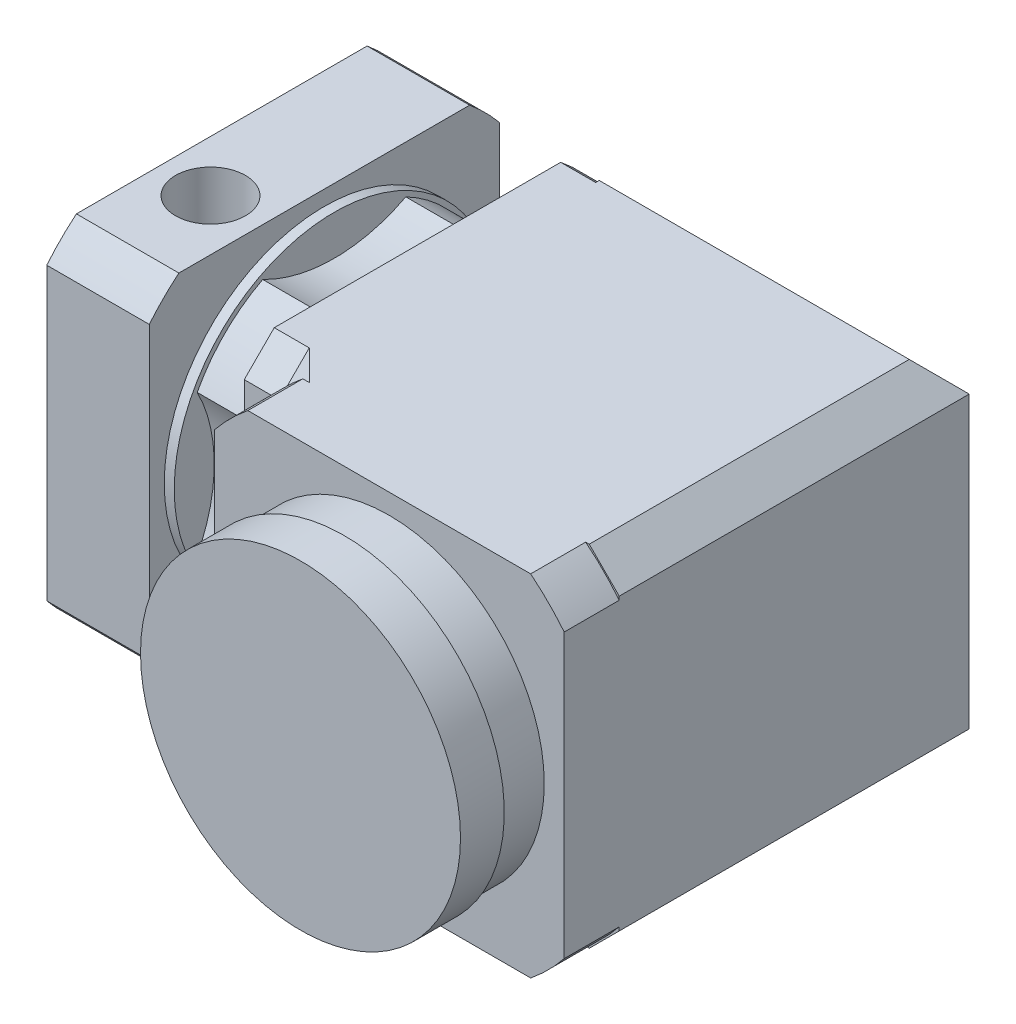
ISO-10303-21;
HEADER;
FILE_DESCRIPTION(('STEP AP214'),'2;1');
FILE_NAME('part.step','',(''),(''),'','','');
FILE_SCHEMA(('AUTOMOTIVE_DESIGN { 1 0 10303 214 1 1 1 1 }'));
ENDSEC;
DATA;
#1=APPLICATION_CONTEXT('core data for automotive mechanical design processes');
#2=APPLICATION_PROTOCOL_DEFINITION('international standard','automotive_design',2000,#1);
#3=PRODUCT_CONTEXT('',#1,'mechanical');
#4=PRODUCT('Part','Part','',(#3));
#5=PRODUCT_RELATED_PRODUCT_CATEGORY('part','',(#4));
#6=PRODUCT_DEFINITION_FORMATION('','',#4);
#7=PRODUCT_DEFINITION_CONTEXT('part definition',#1,'design');
#8=PRODUCT_DEFINITION('design','',#6,#7);
#9=PRODUCT_DEFINITION_SHAPE('','',#8);
#10=(LENGTH_UNIT() NAMED_UNIT(*) SI_UNIT(.MILLI.,.METRE.));
#11=(NAMED_UNIT(*) PLANE_ANGLE_UNIT() SI_UNIT($,.RADIAN.));
#12=(NAMED_UNIT(*) SI_UNIT($,.STERADIAN.) SOLID_ANGLE_UNIT());
#13=UNCERTAINTY_MEASURE_WITH_UNIT(LENGTH_MEASURE(1.E-05),#10,'distance_accuracy_value','');
#14=(GEOMETRIC_REPRESENTATION_CONTEXT(3) GLOBAL_UNCERTAINTY_ASSIGNED_CONTEXT((#13)) GLOBAL_UNIT_ASSIGNED_CONTEXT((#10,
#11,#12)) REPRESENTATION_CONTEXT('',''));
#15=CARTESIAN_POINT('',(0.,0.,0.));
#16=DIRECTION('',(0.,0.,1.));
#17=DIRECTION('',(1.,0.,0.));
#18=AXIS2_PLACEMENT_3D('',#15,#16,#17);
#19=CARTESIAN_POINT('',(59.,0.,46.));
#20=DIRECTION('',(0.,0.,1.));
#21=DIRECTION('',(1.,0.,0.));
#22=AXIS2_PLACEMENT_3D('',#19,#20,#21);
#23=PLANE('',#22);
#24=CARTESIAN_POINT('',(59.,0.,46.));
#25=DIRECTION('',(0.,0.,1.));
#26=DIRECTION('',(1.,0.,0.));
#27=AXIS2_PLACEMENT_3D('',#24,#25,#26);
#28=CIRCLE('',#27,45.);
#29=CARTESIAN_POINT('',(30.7157287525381,35.,46.));
#30=VERTEX_POINT('',#29);
#31=CARTESIAN_POINT('',(24.,28.2842712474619,46.));
#32=VERTEX_POINT('',#31);
#33=EDGE_CURVE('E302',#30,#32,#28,.T.);
#34=ORIENTED_EDGE('',*,*,#33,.T.);
#35=DIRECTION('',(0.,-1.,0.));
#36=VECTOR('',#35,1.);
#37=CARTESIAN_POINT('',(24.,28.2842712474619,46.));
#38=LINE('',#37,#36);
#39=CARTESIAN_POINT('',(24.,-28.2842712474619,46.));
#40=VERTEX_POINT('',#39);
#41=EDGE_CURVE('E292',#32,#40,#38,.T.);
#42=ORIENTED_EDGE('',*,*,#41,.T.);
#43=CARTESIAN_POINT('',(59.,0.,46.));
#44=DIRECTION('',(0.,0.,1.));
#45=DIRECTION('',(1.,0.,0.));
#46=AXIS2_PLACEMENT_3D('',#43,#44,#45);
#47=CIRCLE('',#46,45.);
#48=CARTESIAN_POINT('',(30.7157287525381,-35.,46.));
#49=VERTEX_POINT('',#48);
#50=EDGE_CURVE('E301',#40,#49,#47,.T.);
#51=ORIENTED_EDGE('',*,*,#50,.T.);
#52=DIRECTION('',(1.,0.,0.));
#53=VECTOR('',#52,1.);
#54=CARTESIAN_POINT('',(87.2842712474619,-35.,46.));
#55=LINE('',#54,#53);
#56=CARTESIAN_POINT('',(87.2842712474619,-35.,46.));
#57=VERTEX_POINT('',#56);
#58=EDGE_CURVE('E485',#49,#57,#55,.T.);
#59=ORIENTED_EDGE('',*,*,#58,.T.);
#60=CARTESIAN_POINT('',(59.,0.,46.));
#61=DIRECTION('',(0.,0.,1.));
#62=DIRECTION('',(1.,0.,0.));
#63=AXIS2_PLACEMENT_3D('',#60,#61,#62);
#64=CIRCLE('',#63,45.);
#65=CARTESIAN_POINT('',(94.,-28.2842712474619,46.));
#66=VERTEX_POINT('',#65);
#67=EDGE_CURVE('E483',#57,#66,#64,.T.);
#68=ORIENTED_EDGE('',*,*,#67,.T.);
#69=DIRECTION('',(0.,1.,0.));
#70=VECTOR('',#69,1.);
#71=CARTESIAN_POINT('',(94.,28.2842712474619,46.));
#72=LINE('',#71,#70);
#73=CARTESIAN_POINT('',(94.,28.2842712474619,46.));
#74=VERTEX_POINT('',#73);
#75=EDGE_CURVE('E481',#66,#74,#72,.T.);
#76=ORIENTED_EDGE('',*,*,#75,.T.);
#77=CARTESIAN_POINT('',(59.,0.,46.));
#78=DIRECTION('',(0.,0.,1.));
#79=DIRECTION('',(1.,0.,0.));
#80=AXIS2_PLACEMENT_3D('',#77,#78,#79);
#81=CIRCLE('',#80,45.);
#82=CARTESIAN_POINT('',(87.2842712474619,35.,46.));
#83=VERTEX_POINT('',#82);
#84=EDGE_CURVE('E479',#74,#83,#81,.T.);
#85=ORIENTED_EDGE('',*,*,#84,.T.);
#86=DIRECTION('',(-1.,0.,0.));
#87=VECTOR('',#86,1.);
#88=CARTESIAN_POINT('',(87.2842712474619,35.,46.));
#89=LINE('',#88,#87);
#90=EDGE_CURVE('E307',#83,#30,#89,.T.);
#91=ORIENTED_EDGE('',*,*,#90,.T.);
#92=EDGE_LOOP('',(#34,#42,#51,#59,#68,#76,#85,#91));
#93=FACE_BOUND('',#92,.T.);
#94=CARTESIAN_POINT('',(59.,0.,46.));
#95=DIRECTION('',(0.,0.,1.));
#96=DIRECTION('',(1.,0.,0.));
#97=AXIS2_PLACEMENT_3D('',#94,#95,#96);
#98=CIRCLE('',#97,31.);
#99=CARTESIAN_POINT('',(90.,0.,46.));
#100=VERTEX_POINT('',#99);
#101=EDGE_CURVE('E490',#100,#100,#98,.T.);
#102=ORIENTED_EDGE('',*,*,#101,.F.);
#103=EDGE_LOOP('',(#102));
#104=FACE_BOUND('',#103,.T.);
#105=ADVANCED_FACE('F16',(#93,#104),#23,.T.);
#106=CARTESIAN_POINT('',(26.,29.,35.));
#107=DIRECTION('',(0.,0.,-1.));
#108=DIRECTION('',(0.,1.,0.));
#109=AXIS2_PLACEMENT_3D('',#106,#107,#108);
#110=PLANE('',#109);
#111=CARTESIAN_POINT('',(59.,0.,35.));
#112=DIRECTION('',(0.,0.,1.));
#113=DIRECTION('',(1.,0.,0.));
#114=AXIS2_PLACEMENT_3D('',#111,#112,#113);
#115=CIRCLE('',#114,45.);
#116=CARTESIAN_POINT('',(94.,28.2842712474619,35.));
#117=VERTEX_POINT('',#116);
#118=CARTESIAN_POINT('',(87.2842712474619,35.,35.));
#119=VERTEX_POINT('',#118);
#120=EDGE_CURVE('E325',#117,#119,#115,.T.);
#121=ORIENTED_EDGE('',*,*,#120,.F.);
#122=DIRECTION('',(0.,-1.,0.));
#123=VECTOR('',#122,1.);
#124=CARTESIAN_POINT('',(94.,35.,35.));
#125=LINE('',#124,#123);
#126=CARTESIAN_POINT('',(94.,29.,35.));
#127=VERTEX_POINT('',#126);
#128=EDGE_CURVE('E1608',#127,#117,#125,.T.);
#129=ORIENTED_EDGE('',*,*,#128,.F.);
#130=DIRECTION('',(-0.707106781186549,0.707106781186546,0.));
#131=VECTOR('',#130,1.);
#132=CARTESIAN_POINT('',(94.,29.,35.));
#133=LINE('',#132,#131);
#134=CARTESIAN_POINT('',(88.,35.,35.));
#135=VERTEX_POINT('',#134);
#136=EDGE_CURVE('E1619',#127,#135,#133,.T.);
#137=ORIENTED_EDGE('',*,*,#136,.T.);
#138=DIRECTION('',(-1.,0.,0.));
#139=VECTOR('',#138,1.);
#140=CARTESIAN_POINT('',(94.,35.,35.));
#141=LINE('',#140,#139);
#142=EDGE_CURVE('E451',#135,#119,#141,.T.);
#143=ORIENTED_EDGE('',*,*,#142,.T.);
#144=EDGE_LOOP('',(#121,#129,#137,#143));
#145=FACE_BOUND('',#144,.T.);
#146=ADVANCED_FACE('F517',(#145),#110,.F.);
#147=CARTESIAN_POINT('',(59.,0.,35.));
#148=DIRECTION('',(0.,0.,1.));
#149=DIRECTION('',(1.,0.,0.));
#150=AXIS2_PLACEMENT_3D('',#147,#148,#149);
#151=CIRCLE('',#150,45.);
#152=CARTESIAN_POINT('',(87.2842712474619,-35.,35.));
#153=VERTEX_POINT('',#152);
#154=CARTESIAN_POINT('',(94.,-28.2842712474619,35.));
#155=VERTEX_POINT('',#154);
#156=EDGE_CURVE('E460',#153,#155,#151,.T.);
#157=ORIENTED_EDGE('',*,*,#156,.F.);
#158=DIRECTION('',(-1.,0.,0.));
#159=VECTOR('',#158,1.);
#160=CARTESIAN_POINT('',(94.,-35.,35.));
#161=LINE('',#160,#159);
#162=CARTESIAN_POINT('',(88.,-35.,35.));
#163=VERTEX_POINT('',#162);
#164=EDGE_CURVE('E883',#163,#153,#161,.T.);
#165=ORIENTED_EDGE('',*,*,#164,.F.);
#166=DIRECTION('',(0.707106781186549,0.707106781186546,0.));
#167=VECTOR('',#166,1.);
#168=CARTESIAN_POINT('',(94.,-29.,35.));
#169=LINE('',#168,#167);
#170=CARTESIAN_POINT('',(94.,-29.,35.));
#171=VERTEX_POINT('',#170);
#172=EDGE_CURVE('E1638',#163,#171,#169,.T.);
#173=ORIENTED_EDGE('',*,*,#172,.T.);
#174=EDGE_CURVE('E1589',#155,#171,#125,.T.);
#175=ORIENTED_EDGE('',*,*,#174,.F.);
#176=EDGE_LOOP('',(#157,#165,#173,#175));
#177=FACE_BOUND('',#176,.T.);
#178=ADVANCED_FACE('F523',(#177),#110,.F.);
#179=CARTESIAN_POINT('',(59.,0.,35.));
#180=DIRECTION('',(0.,0.,1.));
#181=DIRECTION('',(1.,0.,0.));
#182=AXIS2_PLACEMENT_3D('',#179,#180,#181);
#183=CIRCLE('',#182,45.);
#184=CARTESIAN_POINT('',(24.5906989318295,29.,35.));
#185=VERTEX_POINT('',#184);
#186=CARTESIAN_POINT('',(24.,28.2842712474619,35.));
#187=VERTEX_POINT('',#186);
#188=EDGE_CURVE('E10',#185,#187,#183,.T.);
#189=ORIENTED_EDGE('',*,*,#188,.F.);
#190=DIRECTION('',(-1.,0.,0.));
#191=VECTOR('',#190,1.);
#192=CARTESIAN_POINT('',(26.,29.,35.));
#193=LINE('',#192,#191);
#194=CARTESIAN_POINT('',(19.,29.,35.));
#195=VERTEX_POINT('',#194);
#196=EDGE_CURVE('E444',#185,#195,#193,.T.);
#197=ORIENTED_EDGE('',*,*,#196,.T.);
#198=DIRECTION('',(0.,-1.,0.));
#199=VECTOR('',#198,1.);
#200=CARTESIAN_POINT('',(19.,29.,35.));
#201=LINE('',#200,#199);
#202=CARTESIAN_POINT('',(19.,-29.,35.));
#203=VERTEX_POINT('',#202);
#204=EDGE_CURVE('E888',#195,#203,#201,.T.);
#205=ORIENTED_EDGE('',*,*,#204,.T.);
#206=DIRECTION('',(-1.,0.,0.));
#207=VECTOR('',#206,1.);
#208=CARTESIAN_POINT('',(26.,-29.,35.));
#209=LINE('',#208,#207);
#210=CARTESIAN_POINT('',(24.5906989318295,-29.,35.));
#211=VERTEX_POINT('',#210);
#212=EDGE_CURVE('E39',#211,#203,#209,.T.);
#213=ORIENTED_EDGE('',*,*,#212,.F.);
#214=CARTESIAN_POINT('',(59.,0.,35.));
#215=DIRECTION('',(0.,0.,1.));
#216=DIRECTION('',(1.,0.,0.));
#217=AXIS2_PLACEMENT_3D('',#214,#215,#216);
#218=CIRCLE('',#217,45.);
#219=CARTESIAN_POINT('',(24.,-28.2842712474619,35.));
#220=VERTEX_POINT('',#219);
#221=EDGE_CURVE('E472',#220,#211,#218,.T.);
#222=ORIENTED_EDGE('',*,*,#221,.F.);
#223=DIRECTION('',(0.,-1.,0.));
#224=VECTOR('',#223,1.);
#225=CARTESIAN_POINT('',(24.,28.2842712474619,35.));
#226=LINE('',#225,#224);
#227=EDGE_CURVE('E34',#187,#220,#226,.T.);
#228=ORIENTED_EDGE('',*,*,#227,.F.);
#229=EDGE_LOOP('',(#189,#197,#205,#213,#222,#228));
#230=FACE_BOUND('',#229,.T.);
#231=ADVANCED_FACE('F526',(#230),#110,.F.);
#232=CARTESIAN_POINT('',(26.,35.,29.));
#233=DIRECTION('',(0.,-1.,0.));
#234=DIRECTION('',(0.,0.,-1.));
#235=AXIS2_PLACEMENT_3D('',#232,#233,#234);
#236=PLANE('',#235);
#237=ORIENTED_EDGE('',*,*,#142,.F.);
#238=DIRECTION('',(0.,0.,-1.));
#239=VECTOR('',#238,1.);
#240=CARTESIAN_POINT('',(88.,35.,-29.));
#241=LINE('',#240,#239);
#242=CARTESIAN_POINT('',(88.,35.,-29.));
#243=VERTEX_POINT('',#242);
#244=EDGE_CURVE('E1640',#135,#243,#241,.T.);
#245=ORIENTED_EDGE('',*,*,#244,.T.);
#246=DIRECTION('',(-1.,0.,0.));
#247=VECTOR('',#246,1.);
#248=CARTESIAN_POINT('',(94.,35.,-29.));
#249=LINE('',#248,#247);
#250=CARTESIAN_POINT('',(26.,35.,-29.));
#251=VERTEX_POINT('',#250);
#252=EDGE_CURVE('E1595',#243,#251,#249,.T.);
#253=ORIENTED_EDGE('',*,*,#252,.T.);
#254=DIRECTION('',(0.,0.,1.));
#255=VECTOR('',#254,1.);
#256=CARTESIAN_POINT('',(26.,35.,35.));
#257=LINE('',#256,#255);
#258=CARTESIAN_POINT('',(26.,35.,-28.2842712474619));
#259=VERTEX_POINT('',#258);
#260=EDGE_CURVE('E1586',#251,#259,#257,.T.);
#261=ORIENTED_EDGE('',*,*,#260,.T.);
#262=DIRECTION('',(-1.,0.,0.));
#263=VECTOR('',#262,1.);
#264=CARTESIAN_POINT('',(26.,35.,-28.2842712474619));
#265=LINE('',#264,#263);
#266=CARTESIAN_POINT('',(19.,35.,-28.2842712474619));
#267=VERTEX_POINT('',#266);
#268=EDGE_CURVE('E412',#259,#267,#265,.T.);
#269=ORIENTED_EDGE('',*,*,#268,.T.);
#270=DIRECTION('',(0.,0.,1.));
#271=VECTOR('',#270,1.);
#272=CARTESIAN_POINT('',(19.,35.,29.));
#273=LINE('',#272,#271);
#274=CARTESIAN_POINT('',(19.,35.,29.));
#275=VERTEX_POINT('',#274);
#276=EDGE_CURVE('E882',#267,#275,#273,.T.);
#277=ORIENTED_EDGE('',*,*,#276,.T.);
#278=DIRECTION('',(-1.,0.,0.));
#279=VECTOR('',#278,1.);
#280=CARTESIAN_POINT('',(26.,35.,29.));
#281=LINE('',#280,#279);
#282=CARTESIAN_POINT('',(26.,35.,29.));
#283=VERTEX_POINT('',#282);
#284=EDGE_CURVE('E416',#283,#275,#281,.T.);
#285=ORIENTED_EDGE('',*,*,#284,.F.);
#286=DIRECTION('',(-0.70728860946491,0.,-0.706924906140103));
#287=VECTOR('',#286,1.);
#288=CARTESIAN_POINT('',(26.,35.,29.));
#289=LINE('',#288,#287);
#290=CARTESIAN_POINT('',(32.0030869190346,35.,35.));
#291=VERTEX_POINT('',#290);
#292=EDGE_CURVE('E388',#291,#283,#289,.T.);
#293=ORIENTED_EDGE('',*,*,#292,.F.);
#294=DIRECTION('',(-1.,0.,0.));
#295=VECTOR('',#294,1.);
#296=CARTESIAN_POINT('',(87.2842712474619,35.,35.));
#297=LINE('',#296,#295);
#298=CARTESIAN_POINT('',(30.7157287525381,35.,35.));
#299=VERTEX_POINT('',#298);
#300=EDGE_CURVE('E311',#291,#299,#297,.T.);
#301=ORIENTED_EDGE('',*,*,#300,.T.);
#302=DIRECTION('',(0.,0.,-1.));
#303=VECTOR('',#302,1.);
#304=CARTESIAN_POINT('',(30.7157287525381,35.,46.));
#305=LINE('',#304,#303);
#306=EDGE_CURVE('E334',#30,#299,#305,.T.);
#307=ORIENTED_EDGE('',*,*,#306,.F.);
#308=ORIENTED_EDGE('',*,*,#90,.F.);
#309=DIRECTION('',(0.,0.,-1.));
#310=VECTOR('',#309,1.);
#311=CARTESIAN_POINT('',(87.2842712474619,35.,46.));
#312=LINE('',#311,#310);
#313=EDGE_CURVE('E335',#83,#119,#312,.T.);
#314=ORIENTED_EDGE('',*,*,#313,.T.);
#315=EDGE_LOOP('',(#237,#245,#253,#261,#269,#277,#285,#293,#301,#307,#308,#314));
#316=FACE_BOUND('',#315,.T.);
#317=ADVANCED_FACE('F612',(#316),#236,.F.);
#318=CARTESIAN_POINT('',(2.,0.,0.));
#319=DIRECTION('',(1.,0.,0.));
#320=DIRECTION('',(0.,0.,-1.));
#321=AXIS2_PLACEMENT_3D('',#318,#319,#320);
#322=PLANE('',#321);
#323=CARTESIAN_POINT('',(2.,0.,0.));
#324=DIRECTION('',(1.,0.,0.));
#325=DIRECTION('',(0.,0.,-1.));
#326=AXIS2_PLACEMENT_3D('',#323,#324,#325);
#327=CIRCLE('',#326,32.);
#328=CARTESIAN_POINT('',(2.,0.,-32.));
#329=VERTEX_POINT('',#328);
#330=EDGE_CURVE('E786',#329,#329,#327,.T.);
#331=ORIENTED_EDGE('',*,*,#330,.T.);
#332=EDGE_LOOP('',(#331));
#333=FACE_BOUND('',#332,.T.);
#334=CARTESIAN_POINT('',(2.,0.,0.));
#335=DIRECTION('',(1.,0.,0.));
#336=DIRECTION('',(0.,0.,-1.));
#337=AXIS2_PLACEMENT_3D('',#334,#335,#336);
#338=CIRCLE('',#337,31.);
#339=CARTESIAN_POINT('',(2.,-14.1259770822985,27.59450618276));
#340=VERTEX_POINT('',#339);
#341=CARTESIAN_POINT('',(2.,-27.2209334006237,14.8330976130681));
#342=VERTEX_POINT('',#341);
#343=EDGE_CURVE('E936',#340,#342,#338,.T.);
#344=ORIENTED_EDGE('',*,*,#343,.F.);
#345=CARTESIAN_POINT('',(2.,0.363291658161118,54.9999999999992));
#346=DIRECTION('',(1.,0.,0.));
#347=DIRECTION('',(0.,0.,-1.));
#348=AXIS2_PLACEMENT_3D('',#345,#346,#347);
#349=CIRCLE('',#348,31.);
#350=CARTESIAN_POINT('',(2.,14.4892687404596,27.4054938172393));
#351=VERTEX_POINT('',#350);
#352=EDGE_CURVE('E834',#351,#340,#349,.F.);
#353=ORIENTED_EDGE('',*,*,#352,.F.);
#354=CARTESIAN_POINT('',(2.,27.5,14.3090880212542));
#355=VERTEX_POINT('',#354);
#356=EDGE_CURVE('E935',#355,#351,#338,.T.);
#357=ORIENTED_EDGE('',*,*,#356,.F.);
#358=CARTESIAN_POINT('',(2.,55.,0.));
#359=DIRECTION('',(1.,0.,0.));
#360=DIRECTION('',(0.,0.,-1.));
#361=AXIS2_PLACEMENT_3D('',#358,#359,#360);
#362=CIRCLE('',#361,31.);
#363=CARTESIAN_POINT('',(2.,27.5,-14.3090880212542));
#364=VERTEX_POINT('',#363);
#365=EDGE_CURVE('E931',#364,#355,#362,.F.);
#366=ORIENTED_EDGE('',*,*,#365,.F.);
#367=CARTESIAN_POINT('',(2.,14.6529016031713,-27.3183541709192));
#368=VERTEX_POINT('',#367);
#369=EDGE_CURVE('E929',#368,#364,#338,.T.);
#370=ORIENTED_EDGE('',*,*,#369,.F.);
#371=CARTESIAN_POINT('',(2.,7.74839429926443E-13,-54.6367083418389));
#372=DIRECTION('',(1.,0.,0.));
#373=DIRECTION('',(0.,0.,-1.));
#374=AXIS2_PLACEMENT_3D('',#371,#372,#373);
#375=CIRCLE('',#374,31.);
#376=CARTESIAN_POINT('',(2.,-14.6529016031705,-27.3183541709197));
#377=VERTEX_POINT('',#376);
#378=EDGE_CURVE('E851',#377,#368,#375,.F.);
#379=ORIENTED_EDGE('',*,*,#378,.F.);
#380=CARTESIAN_POINT('',(2.,-27.4157749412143,-14.4698059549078));
#381=VERTEX_POINT('',#380);
#382=EDGE_CURVE('E927',#381,#377,#338,.T.);
#383=ORIENTED_EDGE('',*,*,#382,.F.);
#384=CARTESIAN_POINT('',(2.,-54.6367083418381,0.36329165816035));
#385=DIRECTION('',(1.,0.,0.));
#386=DIRECTION('',(0.,0.,-1.));
#387=AXIS2_PLACEMENT_3D('',#384,#385,#386);
#388=CIRCLE('',#387,31.);
#389=EDGE_CURVE('E840',#342,#381,#388,.F.);
#390=ORIENTED_EDGE('',*,*,#389,.F.);
#391=EDGE_LOOP('',(#344,#353,#357,#366,#370,#379,#383,#390));
#392=FACE_BOUND('',#391,.T.);
#393=ADVANCED_FACE('F615',(#333,#392),#322,.T.);
#394=CARTESIAN_POINT('',(0.,-35.,-35.));
#395=DIRECTION('',(-1.,0.,0.));
#396=DIRECTION('',(0.,0.,1.));
#397=AXIS2_PLACEMENT_3D('',#394,#395,#396);
#398=PLANE('',#397);
#399=CARTESIAN_POINT('',(0.,0.,0.));
#400=DIRECTION('',(-1.,0.,0.));
#401=DIRECTION('',(0.,0.,1.));
#402=AXIS2_PLACEMENT_3D('',#399,#400,#401);
#403=CIRCLE('',#402,22.);
#404=CARTESIAN_POINT('',(0.,0.,22.));
#405=VERTEX_POINT('',#404);
#406=EDGE_CURVE('E729',#405,#405,#403,.F.);
#407=ORIENTED_EDGE('',*,*,#406,.F.);
#408=EDGE_LOOP('',(#407));
#409=FACE_BOUND('',#408,.T.);
#410=CARTESIAN_POINT('',(0.,0.,0.));
#411=DIRECTION('',(-1.,0.,0.));
#412=DIRECTION('',(0.,0.,1.));
#413=AXIS2_PLACEMENT_3D('',#410,#411,#412);
#414=CIRCLE('',#413,17.5);
#415=CARTESIAN_POINT('',(0.,0.,17.5));
#416=VERTEX_POINT('',#415);
#417=EDGE_CURVE('E723',#416,#416,#414,.T.);
#418=ORIENTED_EDGE('',*,*,#417,.F.);
#419=EDGE_LOOP('',(#418));
#420=FACE_BOUND('',#419,.T.);
#421=ADVANCED_FACE('F1354',(#409,#420),#398,.T.);
#422=CARTESIAN_POINT('',(0.,-35.,-35.));
#423=DIRECTION('',(-1.,0.,0.));
#424=DIRECTION('',(0.,0.,1.));
#425=AXIS2_PLACEMENT_3D('',#422,#423,#424);
#426=PLANE('',#425);
#427=CARTESIAN_POINT('',(0.,0.,0.));
#428=DIRECTION('',(-1.,0.,0.));
#429=DIRECTION('',(0.,0.,1.));
#430=AXIS2_PLACEMENT_3D('',#427,#428,#429);
#431=CIRCLE('',#430,32.);
#432=CARTESIAN_POINT('',(0.,0.,32.));
#433=VERTEX_POINT('',#432);
#434=EDGE_CURVE('E773',#433,#433,#431,.T.);
#435=ORIENTED_EDGE('',*,*,#434,.T.);
#436=EDGE_LOOP('',(#435));
#437=FACE_BOUND('',#436,.T.);
#438=CARTESIAN_POINT('',(0.,0.,0.));
#439=DIRECTION('',(-1.,0.,0.));
#440=DIRECTION('',(0.,0.,1.));
#441=AXIS2_PLACEMENT_3D('',#438,#439,#440);
#442=CIRCLE('',#441,45.5);
#443=CARTESIAN_POINT('',(0.,29.0731835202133,35.));
#444=VERTEX_POINT('',#443);
#445=CARTESIAN_POINT('',(0.,35.,29.0731835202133));
#446=VERTEX_POINT('',#445);
#447=EDGE_CURVE('E744',#444,#446,#442,.T.);
#448=ORIENTED_EDGE('',*,*,#447,.F.);
#449=DIRECTION('',(0.,1.,0.));
#450=VECTOR('',#449,1.);
#451=CARTESIAN_POINT('',(0.,35.,35.));
#452=LINE('',#451,#450);
#453=CARTESIAN_POINT('',(0.,-29.0731835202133,35.));
#454=VERTEX_POINT('',#453);
#455=EDGE_CURVE('E779',#454,#444,#452,.T.);
#456=ORIENTED_EDGE('',*,*,#455,.F.);
#457=CARTESIAN_POINT('',(0.,-35.,29.0731835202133));
#458=VERTEX_POINT('',#457);
#459=EDGE_CURVE('E752',#458,#454,#442,.T.);
#460=ORIENTED_EDGE('',*,*,#459,.F.);
#461=DIRECTION('',(0.,0.,1.));
#462=VECTOR('',#461,1.);
#463=CARTESIAN_POINT('',(0.,-35.,-35.));
#464=LINE('',#463,#462);
#465=CARTESIAN_POINT('',(0.,-35.,-29.0731835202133));
#466=VERTEX_POINT('',#465);
#467=EDGE_CURVE('E776',#466,#458,#464,.T.);
#468=ORIENTED_EDGE('',*,*,#467,.F.);
#469=CARTESIAN_POINT('',(0.,-29.0731835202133,-35.));
#470=VERTEX_POINT('',#469);
#471=EDGE_CURVE('E743',#470,#466,#442,.T.);
#472=ORIENTED_EDGE('',*,*,#471,.F.);
#473=DIRECTION('',(0.,-1.,0.));
#474=VECTOR('',#473,1.);
#475=CARTESIAN_POINT('',(0.,35.,-35.));
#476=LINE('',#475,#474);
#477=CARTESIAN_POINT('',(0.,29.0731835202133,-35.));
#478=VERTEX_POINT('',#477);
#479=EDGE_CURVE('E759',#478,#470,#476,.T.);
#480=ORIENTED_EDGE('',*,*,#479,.F.);
#481=CARTESIAN_POINT('',(0.,35.,-29.0731835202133));
#482=VERTEX_POINT('',#481);
#483=EDGE_CURVE('E740',#482,#478,#442,.T.);
#484=ORIENTED_EDGE('',*,*,#483,.F.);
#485=DIRECTION('',(0.,0.,-1.));
#486=VECTOR('',#485,1.);
#487=CARTESIAN_POINT('',(0.,35.,-35.));
#488=LINE('',#487,#486);
#489=EDGE_CURVE('E764',#446,#482,#488,.T.);
#490=ORIENTED_EDGE('',*,*,#489,.F.);
#491=EDGE_LOOP('',(#448,#456,#460,#468,#472,#480,#484,#490));
#492=FACE_BOUND('',#491,.T.);
#493=ADVANCED_FACE('F1345',(#437,#492),#426,.F.);
#494=CARTESIAN_POINT('',(-20.5,35.,-35.));
#495=DIRECTION('',(0.,0.,1.));
#496=DIRECTION('',(1.,0.,0.));
#497=AXIS2_PLACEMENT_3D('',#494,#495,#496);
#498=PLANE('',#497);
#499=DIRECTION('',(-1.,0.,0.));
#500=VECTOR('',#499,1.);
#501=CARTESIAN_POINT('',(2.,29.0731835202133,-35.));
#502=LINE('',#501,#500);
#503=CARTESIAN_POINT('',(-20.5,29.0731835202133,-35.));
#504=VERTEX_POINT('',#503);
#505=EDGE_CURVE('E742',#478,#504,#502,.T.);
#506=ORIENTED_EDGE('',*,*,#505,.F.);
#507=ORIENTED_EDGE('',*,*,#479,.T.);
#508=DIRECTION('',(-1.,0.,0.));
#509=VECTOR('',#508,1.);
#510=CARTESIAN_POINT('',(2.,-29.0731835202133,-35.));
#511=LINE('',#510,#509);
#512=CARTESIAN_POINT('',(-20.5,-29.0731835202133,-35.));
#513=VERTEX_POINT('',#512);
#514=EDGE_CURVE('E757',#513,#470,#511,.F.);
#515=ORIENTED_EDGE('',*,*,#514,.F.);
#516=DIRECTION('',(0.,-1.,0.));
#517=VECTOR('',#516,1.);
#518=CARTESIAN_POINT('',(-20.5,35.,-35.));
#519=LINE('',#518,#517);
#520=EDGE_CURVE('E760',#504,#513,#519,.T.);
#521=ORIENTED_EDGE('',*,*,#520,.F.);
#522=EDGE_LOOP('',(#506,#507,#515,#521));
#523=FACE_BOUND('',#522,.T.);
#524=ADVANCED_FACE('F1336',(#523),#498,.F.);
#525=CARTESIAN_POINT('',(-20.5,-35.,-35.));
#526=DIRECTION('',(0.,1.,0.));
#527=DIRECTION('',(0.,0.,1.));
#528=AXIS2_PLACEMENT_3D('',#525,#526,#527);
#529=PLANE('',#528);
#530=DIRECTION('',(-1.,0.,0.));
#531=VECTOR('',#530,1.);
#532=CARTESIAN_POINT('',(2.,-35.,-29.0731835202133));
#533=LINE('',#532,#531);
#534=CARTESIAN_POINT('',(-20.5,-35.,-29.0731835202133));
#535=VERTEX_POINT('',#534);
#536=EDGE_CURVE('E755',#466,#535,#533,.T.);
#537=ORIENTED_EDGE('',*,*,#536,.F.);
#538=ORIENTED_EDGE('',*,*,#467,.T.);
#539=DIRECTION('',(-1.,0.,0.));
#540=VECTOR('',#539,1.);
#541=CARTESIAN_POINT('',(2.,-35.,29.0731835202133));
#542=LINE('',#541,#540);
#543=CARTESIAN_POINT('',(-20.5,-35.,29.0731835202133));
#544=VERTEX_POINT('',#543);
#545=EDGE_CURVE('E753',#544,#458,#542,.F.);
#546=ORIENTED_EDGE('',*,*,#545,.F.);
#547=DIRECTION('',(0.,0.,1.));
#548=VECTOR('',#547,1.);
#549=CARTESIAN_POINT('',(-20.5,-35.,-35.));
#550=LINE('',#549,#548);
#551=EDGE_CURVE('E763',#535,#544,#550,.T.);
#552=ORIENTED_EDGE('',*,*,#551,.F.);
#553=EDGE_LOOP('',(#537,#538,#546,#552));
#554=FACE_BOUND('',#553,.T.);
#555=ADVANCED_FACE('F1327',(#554),#529,.F.);
#556=CARTESIAN_POINT('',(-20.5,35.,35.));
#557=DIRECTION('',(0.,0.,-1.));
#558=DIRECTION('',(-1.,0.,0.));
#559=AXIS2_PLACEMENT_3D('',#556,#557,#558);
#560=PLANE('',#559);
#561=DIRECTION('',(-1.,0.,0.));
#562=VECTOR('',#561,1.);
#563=CARTESIAN_POINT('',(2.,-29.0731835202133,35.));
#564=LINE('',#563,#562);
#565=CARTESIAN_POINT('',(-20.5,-29.0731835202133,35.));
#566=VERTEX_POINT('',#565);
#567=EDGE_CURVE('E750',#454,#566,#564,.T.);
#568=ORIENTED_EDGE('',*,*,#567,.F.);
#569=ORIENTED_EDGE('',*,*,#455,.T.);
#570=DIRECTION('',(-1.,0.,0.));
#571=VECTOR('',#570,1.);
#572=CARTESIAN_POINT('',(2.,29.0731835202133,35.));
#573=LINE('',#572,#571);
#574=CARTESIAN_POINT('',(-20.5,29.0731835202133,35.));
#575=VERTEX_POINT('',#574);
#576=EDGE_CURVE('E748',#575,#444,#573,.F.);
#577=ORIENTED_EDGE('',*,*,#576,.F.);
#578=DIRECTION('',(0.,1.,0.));
#579=VECTOR('',#578,1.);
#580=CARTESIAN_POINT('',(-20.5,35.,35.));
#581=LINE('',#580,#579);
#582=EDGE_CURVE('E767',#566,#575,#581,.T.);
#583=ORIENTED_EDGE('',*,*,#582,.F.);
#584=EDGE_LOOP('',(#568,#569,#577,#583));
#585=FACE_BOUND('',#584,.T.);
#586=ADVANCED_FACE('F1318',(#585),#560,.F.);
#587=CARTESIAN_POINT('',(-20.5,35.,-35.));
#588=DIRECTION('',(0.,-1.,0.));
#589=DIRECTION('',(0.,0.,-1.));
#590=AXIS2_PLACEMENT_3D('',#587,#588,#589);
#591=PLANE('',#590);
#592=CARTESIAN_POINT('',(-10.25,35.,12.5));
#593=DIRECTION('',(0.,1.,0.));
#594=DIRECTION('',(0.,0.,1.));
#595=AXIS2_PLACEMENT_3D('',#592,#593,#594);
#596=CIRCLE('',#595,7.00000000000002);
#597=CARTESIAN_POINT('',(-10.25,35.,19.5));
#598=VERTEX_POINT('',#597);
#599=EDGE_CURVE('E662',#598,#598,#596,.T.);
#600=ORIENTED_EDGE('',*,*,#599,.F.);
#601=EDGE_LOOP('',(#600));
#602=FACE_BOUND('',#601,.T.);
#603=DIRECTION('',(-1.,0.,0.));
#604=VECTOR('',#603,1.);
#605=CARTESIAN_POINT('',(2.,35.,29.0731835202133));
#606=LINE('',#605,#604);
#607=CARTESIAN_POINT('',(-20.5,35.,29.0731835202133));
#608=VERTEX_POINT('',#607);
#609=EDGE_CURVE('E746',#446,#608,#606,.T.);
#610=ORIENTED_EDGE('',*,*,#609,.F.);
#611=ORIENTED_EDGE('',*,*,#489,.T.);
#612=DIRECTION('',(-1.,0.,0.));
#613=VECTOR('',#612,1.);
#614=CARTESIAN_POINT('',(2.,35.,-29.0731835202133));
#615=LINE('',#614,#613);
#616=CARTESIAN_POINT('',(-20.5,35.,-29.0731835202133));
#617=VERTEX_POINT('',#616);
#618=EDGE_CURVE('E738',#617,#482,#615,.F.);
#619=ORIENTED_EDGE('',*,*,#618,.F.);
#620=DIRECTION('',(0.,0.,-1.));
#621=VECTOR('',#620,1.);
#622=CARTESIAN_POINT('',(-20.5,35.,-35.));
#623=LINE('',#622,#621);
#624=EDGE_CURVE('E770',#608,#617,#623,.T.);
#625=ORIENTED_EDGE('',*,*,#624,.F.);
#626=EDGE_LOOP('',(#610,#611,#619,#625));
#627=FACE_BOUND('',#626,.T.);
#628=ADVANCED_FACE('F1309',(#602,#627),#591,.F.);
#629=CARTESIAN_POINT('',(-20.5,-35.,-35.));
#630=DIRECTION('',(-1.,0.,0.));
#631=DIRECTION('',(0.,0.,1.));
#632=AXIS2_PLACEMENT_3D('',#629,#630,#631);
#633=PLANE('',#632);
#634=CARTESIAN_POINT('',(-20.5,-23.5731723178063,23.5731723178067));
#635=DIRECTION('',(-1.,0.,0.));
#636=DIRECTION('',(0.,-1.,0.));
#637=AXIS2_PLACEMENT_3D('',#634,#635,#636);
#638=CIRCLE('',#637,1.99999999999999);
#639=CARTESIAN_POINT('',(-20.5,-25.5731723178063,23.5731723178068));
#640=VERTEX_POINT('',#639);
#641=EDGE_CURVE('E675',#640,#640,#638,.T.);
#642=ORIENTED_EDGE('',*,*,#641,.F.);
#643=EDGE_LOOP('',(#642));
#644=FACE_BOUND('',#643,.T.);
#645=CARTESIAN_POINT('',(-20.5,-23.5731723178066,-23.5731723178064));
#646=DIRECTION('',(-1.,0.,0.));
#647=DIRECTION('',(0.,0.,-1.));
#648=AXIS2_PLACEMENT_3D('',#645,#646,#647);
#649=CIRCLE('',#648,1.99999999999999);
#650=CARTESIAN_POINT('',(-20.5,-23.5731723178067,-25.5731723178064));
#651=VERTEX_POINT('',#650);
#652=EDGE_CURVE('E690',#651,#651,#649,.T.);
#653=ORIENTED_EDGE('',*,*,#652,.F.);
#654=EDGE_LOOP('',(#653));
#655=FACE_BOUND('',#654,.T.);
#656=CARTESIAN_POINT('',(-20.5,23.5731723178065,-23.5731723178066));
#657=DIRECTION('',(-1.,0.,0.));
#658=DIRECTION('',(0.,1.,0.));
#659=AXIS2_PLACEMENT_3D('',#656,#657,#658);
#660=CIRCLE('',#659,1.99999999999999);
#661=CARTESIAN_POINT('',(-20.5,25.5731723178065,-23.5731723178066));
#662=VERTEX_POINT('',#661);
#663=EDGE_CURVE('E705',#662,#662,#660,.T.);
#664=ORIENTED_EDGE('',*,*,#663,.F.);
#665=EDGE_LOOP('',(#664));
#666=FACE_BOUND('',#665,.T.);
#667=CARTESIAN_POINT('',(-20.5,23.5731723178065,23.5731723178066));
#668=DIRECTION('',(-1.,0.,0.));
#669=DIRECTION('',(0.,0.,1.));
#670=AXIS2_PLACEMENT_3D('',#667,#668,#669);
#671=CIRCLE('',#670,1.99999999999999);
#672=CARTESIAN_POINT('',(-20.5,23.5731723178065,25.5731723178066));
#673=VERTEX_POINT('',#672);
#674=EDGE_CURVE('E720',#673,#673,#671,.T.);
#675=ORIENTED_EDGE('',*,*,#674,.F.);
#676=EDGE_LOOP('',(#675));
#677=FACE_BOUND('',#676,.T.);
#678=CARTESIAN_POINT('',(-20.5,0.,0.));
#679=DIRECTION('',(-1.,0.,0.));
#680=DIRECTION('',(0.,0.,1.));
#681=AXIS2_PLACEMENT_3D('',#678,#679,#680);
#682=CIRCLE('',#681,19.55);
#683=CARTESIAN_POINT('',(-20.5,0.,19.55));
#684=VERTEX_POINT('',#683);
#685=EDGE_CURVE('E809',#684,#684,#682,.F.);
#686=ORIENTED_EDGE('',*,*,#685,.T.);
#687=EDGE_LOOP('',(#686));
#688=FACE_BOUND('',#687,.T.);
#689=ORIENTED_EDGE('',*,*,#582,.T.);
#690=CARTESIAN_POINT('',(-20.5,0.,0.));
#691=DIRECTION('',(-1.,0.,0.));
#692=DIRECTION('',(0.,0.,1.));
#693=AXIS2_PLACEMENT_3D('',#690,#691,#692);
#694=CIRCLE('',#693,45.5);
#695=EDGE_CURVE('E735',#575,#608,#694,.T.);
#696=ORIENTED_EDGE('',*,*,#695,.T.);
#697=ORIENTED_EDGE('',*,*,#624,.T.);
#698=CARTESIAN_POINT('',(-20.5,0.,0.));
#699=DIRECTION('',(-1.,0.,0.));
#700=DIRECTION('',(0.,0.,1.));
#701=AXIS2_PLACEMENT_3D('',#698,#699,#700);
#702=CIRCLE('',#701,45.5);
#703=EDGE_CURVE('E793',#617,#504,#702,.T.);
#704=ORIENTED_EDGE('',*,*,#703,.T.);
#705=ORIENTED_EDGE('',*,*,#520,.T.);
#706=EDGE_CURVE('E792',#513,#535,#702,.T.);
#707=ORIENTED_EDGE('',*,*,#706,.T.);
#708=ORIENTED_EDGE('',*,*,#551,.T.);
#709=EDGE_CURVE('E789',#544,#566,#702,.T.);
#710=ORIENTED_EDGE('',*,*,#709,.T.);
#711=EDGE_LOOP('',(#689,#696,#697,#704,#705,#707,#708,#710));
#712=FACE_BOUND('',#711,.T.);
#713=ADVANCED_FACE('F1300',(#644,#655,#666,#677,#688,#712),#633,.T.);
#714=CARTESIAN_POINT('',(2.,0.,0.));
#715=DIRECTION('',(-1.,0.,0.));
#716=DIRECTION('',(0.,0.,1.));
#717=AXIS2_PLACEMENT_3D('',#714,#715,#716);
#718=CYLINDRICAL_SURFACE('',#717,32.);
#719=ORIENTED_EDGE('',*,*,#330,.F.);
#720=EDGE_LOOP('',(#719));
#721=FACE_BOUND('',#720,.T.);
#722=ORIENTED_EDGE('',*,*,#434,.F.);
#723=EDGE_LOOP('',(#722));
#724=FACE_BOUND('',#723,.T.);
#725=ADVANCED_FACE('F1292',(#721,#724),#718,.T.);
#726=CARTESIAN_POINT('',(2.,0.,0.));
#727=DIRECTION('',(-1.,0.,0.));
#728=DIRECTION('',(0.,0.,1.));
#729=AXIS2_PLACEMENT_3D('',#726,#727,#728);
#730=CYLINDRICAL_SURFACE('',#729,45.5);
#731=ORIENTED_EDGE('',*,*,#545,.T.);
#732=ORIENTED_EDGE('',*,*,#459,.T.);
#733=ORIENTED_EDGE('',*,*,#567,.T.);
#734=ORIENTED_EDGE('',*,*,#709,.F.);
#735=EDGE_LOOP('',(#731,#732,#733,#734));
#736=FACE_BOUND('',#735,.T.);
#737=ADVANCED_FACE('F1270',(#736),#730,.T.);
#738=ORIENTED_EDGE('',*,*,#514,.T.);
#739=ORIENTED_EDGE('',*,*,#471,.T.);
#740=ORIENTED_EDGE('',*,*,#536,.T.);
#741=ORIENTED_EDGE('',*,*,#706,.F.);
#742=EDGE_LOOP('',(#738,#739,#740,#741));
#743=FACE_BOUND('',#742,.T.);
#744=ADVANCED_FACE('F1277',(#743),#730,.T.);
#745=ORIENTED_EDGE('',*,*,#505,.T.);
#746=ORIENTED_EDGE('',*,*,#703,.F.);
#747=ORIENTED_EDGE('',*,*,#618,.T.);
#748=ORIENTED_EDGE('',*,*,#483,.T.);
#749=EDGE_LOOP('',(#745,#746,#747,#748));
#750=FACE_BOUND('',#749,.T.);
#751=ADVANCED_FACE('F1267',(#750),#730,.T.);
#752=ORIENTED_EDGE('',*,*,#576,.T.);
#753=ORIENTED_EDGE('',*,*,#447,.T.);
#754=ORIENTED_EDGE('',*,*,#609,.T.);
#755=ORIENTED_EDGE('',*,*,#695,.F.);
#756=EDGE_LOOP('',(#752,#753,#754,#755));
#757=FACE_BOUND('',#756,.T.);
#758=ADVANCED_FACE('F1258',(#757),#730,.T.);
#759=CARTESIAN_POINT('',(-17.5108,0.,0.));
#760=DIRECTION('',(-1.,0.,0.));
#761=DIRECTION('',(0.,0.,1.));
#762=AXIS2_PLACEMENT_3D('',#759,#760,#761);
#763=CYLINDRICAL_SURFACE('',#762,19.05);
#764=CARTESIAN_POINT('',(-20.,0.,0.));
#765=DIRECTION('',(-1.,0.,0.));
#766=DIRECTION('',(0.,0.,1.));
#767=AXIS2_PLACEMENT_3D('',#764,#765,#766);
#768=CIRCLE('',#767,19.05);
#769=CARTESIAN_POINT('',(-20.,0.,19.05));
#770=VERTEX_POINT('',#769);
#771=EDGE_CURVE('E806',#770,#770,#768,.T.);
#772=ORIENTED_EDGE('',*,*,#771,.T.);
#773=EDGE_LOOP('',(#772));
#774=FACE_BOUND('',#773,.T.);
#775=CARTESIAN_POINT('',(-17.5108,0.,0.));
#776=DIRECTION('',(-1.,0.,0.));
#777=DIRECTION('',(0.,0.,1.));
#778=AXIS2_PLACEMENT_3D('',#775,#776,#777);
#779=CIRCLE('',#778,19.05);
#780=CARTESIAN_POINT('',(-17.5108,0.,19.05));
#781=VERTEX_POINT('',#780);
#782=EDGE_CURVE('E732',#781,#781,#779,.F.);
#783=ORIENTED_EDGE('',*,*,#782,.T.);
#784=EDGE_LOOP('',(#783));
#785=FACE_BOUND('',#784,.T.);
#786=ADVANCED_FACE('F1249',(#774,#785),#763,.F.);
#787=CARTESIAN_POINT('',(-17.5108,0.,0.));
#788=DIRECTION('',(-1.,0.,0.));
#789=DIRECTION('',(0.,0.,1.));
#790=AXIS2_PLACEMENT_3D('',#787,#788,#789);
#791=PLANE('',#790);
#792=CARTESIAN_POINT('',(-17.5108,0.,0.));
#793=DIRECTION('',(-1.,0.,0.));
#794=DIRECTION('',(0.,0.,1.));
#795=AXIS2_PLACEMENT_3D('',#792,#793,#794);
#796=CIRCLE('',#795,22.);
#797=CARTESIAN_POINT('',(-17.5108,0.,22.));
#798=VERTEX_POINT('',#797);
#799=EDGE_CURVE('E726',#798,#798,#796,.T.);
#800=ORIENTED_EDGE('',*,*,#799,.F.);
#801=EDGE_LOOP('',(#800));
#802=FACE_BOUND('',#801,.T.);
#803=ORIENTED_EDGE('',*,*,#782,.F.);
#804=EDGE_LOOP('',(#803));
#805=FACE_BOUND('',#804,.T.);
#806=ADVANCED_FACE('F1240',(#802,#805),#791,.F.);
#807=CARTESIAN_POINT('',(62.2253967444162,0.,0.));
#808=DIRECTION('',(-1.,0.,0.));
#809=DIRECTION('',(0.,0.,1.));
#810=AXIS2_PLACEMENT_3D('',#807,#808,#809);
#811=CYLINDRICAL_SURFACE('',#810,22.);
#812=CARTESIAN_POINT('',(-10.25,10.1857743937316,19.5));
#813=CARTESIAN_POINT('',(-10.3521413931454,10.1857745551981,19.4999999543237));
#814=CARTESIAN_POINT('',(-10.4542838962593,10.1900721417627,19.4977571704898));
#815=CARTESIAN_POINT('',(-10.6576495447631,10.2070714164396,19.4888627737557));
#816=CARTESIAN_POINT('',(-10.7588726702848,10.2197732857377,19.4822110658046));
#817=CARTESIAN_POINT('',(-11.060200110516,10.2698899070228,19.4558698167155));
#818=CARTESIAN_POINT('',(-11.2578354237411,10.3193148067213,19.4297944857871));
#819=CARTESIAN_POINT('',(-11.7024030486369,10.4637424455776,19.3524814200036));
#820=CARTESIAN_POINT('',(-11.9452091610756,10.5682065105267,19.2958997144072));
#821=CARTESIAN_POINT('',(-12.4095720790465,10.8074057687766,19.1629510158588));
#822=CARTESIAN_POINT('',(-12.631071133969,10.9422200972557,19.0865322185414));
#823=CARTESIAN_POINT('',(-13.0283352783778,11.2137318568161,18.9281252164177));
#824=CARTESIAN_POINT('',(-13.206386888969,11.3482089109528,18.8479427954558));
#825=CARTESIAN_POINT('',(-13.5488366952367,11.6275326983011,18.6769195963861));
#826=CARTESIAN_POINT('',(-13.7132244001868,11.7723872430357,18.5860707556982));
#827=CARTESIAN_POINT('',(-14.0299673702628,12.0694019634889,18.3945875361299));
#828=CARTESIAN_POINT('',(-14.1822938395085,12.2215783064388,18.2939309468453));
#829=CARTESIAN_POINT('',(-14.4755142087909,12.5305727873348,18.0836860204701));
#830=CARTESIAN_POINT('',(-14.6164099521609,12.6873901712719,17.9740991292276));
#831=CARTESIAN_POINT('',(-14.9584688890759,13.0868053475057,17.6868201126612));
#832=CARTESIAN_POINT('',(-15.1526201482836,13.3313787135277,17.5034802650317));
#833=CARTESIAN_POINT('',(-15.5174969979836,13.8231437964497,17.117783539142));
#834=CARTESIAN_POINT('',(-15.688210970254,14.0703367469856,16.9154173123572));
#835=CARTESIAN_POINT('',(-16.0059658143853,14.5639374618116,16.4923413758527));
#836=CARTESIAN_POINT('',(-16.1530209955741,14.8103456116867,16.2716428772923));
#837=CARTESIAN_POINT('',(-16.4224763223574,15.2997868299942,15.8123083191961));
#838=CARTESIAN_POINT('',(-16.5448853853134,15.5428210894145,15.5736787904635));
#839=CARTESIAN_POINT('',(-16.7428224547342,15.9783421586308,15.1251871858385));
#840=CARTESIAN_POINT('',(-16.8228359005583,16.1718097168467,14.9182496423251));
#841=CARTESIAN_POINT('',(-16.963895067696,16.5536240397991,14.4934144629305));
#842=CARTESIAN_POINT('',(-17.0249409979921,16.7419708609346,14.275516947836));
#843=CARTESIAN_POINT('',(-17.1262964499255,17.1119006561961,13.8299163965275));
#844=CARTESIAN_POINT('',(-17.1666362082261,17.2934931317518,13.6022281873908));
#845=CARTESIAN_POINT('',(-17.2247896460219,17.6487711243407,13.1379694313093));
#846=CARTESIAN_POINT('',(-17.2426083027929,17.8224583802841,12.9014008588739));
#847=CARTESIAN_POINT('',(-17.2525588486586,18.1263309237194,12.4696069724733));
#848=CARTESIAN_POINT('',(-17.2491503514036,18.2582194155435,12.2756772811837));
#849=CARTESIAN_POINT('',(-17.2256327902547,18.515272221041,11.8844202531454));
#850=CARTESIAN_POINT('',(-17.2055272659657,18.640437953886,11.687093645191));
#851=CARTESIAN_POINT('',(-17.1476198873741,18.8833186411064,11.2904538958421));
#852=CARTESIAN_POINT('',(-17.1098193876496,19.001034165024,11.0911409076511));
#853=CARTESIAN_POINT('',(-17.015645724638,19.2283359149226,10.6922303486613));
#854=CARTESIAN_POINT('',(-16.9592722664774,19.3379220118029,10.4926327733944));
#855=CARTESIAN_POINT('',(-16.8267684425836,19.5491711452,10.0936245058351));
#856=CARTESIAN_POINT('',(-16.7504881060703,19.6507660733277,9.89422729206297));
#857=CARTESIAN_POINT('',(-16.5779884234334,19.8445878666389,9.49950925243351));
#858=CARTESIAN_POINT('',(-16.4817686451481,19.9368145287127,9.30418851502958));
#859=CARTESIAN_POINT('',(-16.2694258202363,20.1115292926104,8.92024994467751));
#860=CARTESIAN_POINT('',(-16.1533130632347,20.194022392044,8.7316287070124));
#861=CARTESIAN_POINT('',(-15.9015519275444,20.3491949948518,8.36361987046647));
#862=CARTESIAN_POINT('',(-15.7659064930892,20.4218759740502,8.18423088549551));
#863=CARTESIAN_POINT('',(-15.4948084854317,20.5486859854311,7.85988427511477));
#864=CARTESIAN_POINT('',(-15.3616284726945,20.6039984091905,7.71348406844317));
#865=CARTESIAN_POINT('',(-15.0819275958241,20.7074545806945,7.43127911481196));
#866=CARTESIAN_POINT('',(-14.9354077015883,20.7555988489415,7.29547359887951));
#867=CARTESIAN_POINT('',(-14.6300824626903,20.8449792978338,7.0360265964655));
#868=CARTESIAN_POINT('',(-14.4712803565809,20.8862172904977,6.91238192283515));
#869=CARTESIAN_POINT('',(-14.1425551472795,20.9621421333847,6.6786008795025));
#870=CARTESIAN_POINT('',(-13.972632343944,20.9968291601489,6.56846414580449));
#871=CARTESIAN_POINT('',(-13.634475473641,21.0579608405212,6.36964572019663));
#872=CARTESIAN_POINT('',(-13.4668592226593,21.0847964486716,6.28003143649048));
#873=CARTESIAN_POINT('',(-13.1242919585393,21.1333942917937,6.11449842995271));
#874=CARTESIAN_POINT('',(-12.9493411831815,21.1551566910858,6.03857926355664));
#875=CARTESIAN_POINT('',(-12.5933817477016,21.1939060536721,5.9011395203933));
#876=CARTESIAN_POINT('',(-12.4123736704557,21.210893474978,5.839617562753));
#877=CARTESIAN_POINT('',(-12.0455899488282,21.2403600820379,5.73151338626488));
#878=CARTESIAN_POINT('',(-11.8598142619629,21.2528392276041,5.6849313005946));
#879=CARTESIAN_POINT('',(-11.4864744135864,21.2734113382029,5.60745608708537));
#880=CARTESIAN_POINT('',(-11.2989398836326,21.2815415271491,5.57642996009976));
#881=CARTESIAN_POINT('',(-10.9217722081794,21.2937270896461,5.52971708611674));
#882=CARTESIAN_POINT('',(-10.7321383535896,21.2977810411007,5.51403569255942));
#883=CARTESIAN_POINT('',(-10.3522533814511,21.30188330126,5.49816654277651));
#884=CARTESIAN_POINT('',(-10.1620025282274,21.3019331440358,5.49797285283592));
#885=CARTESIAN_POINT('',(-9.78207074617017,21.2980311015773,5.51306916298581));
#886=CARTESIAN_POINT('',(-9.59239011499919,21.2940774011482,5.52836618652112));
#887=CARTESIAN_POINT('',(-9.21464829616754,21.2820802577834,5.57437216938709));
#888=CARTESIAN_POINT('',(-9.02659115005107,21.274028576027,5.60511217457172));
#889=CARTESIAN_POINT('',(-8.65391069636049,21.2536914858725,5.68173974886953));
#890=CARTESIAN_POINT('',(-8.46928586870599,21.2414080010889,5.72762043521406));
#891=CARTESIAN_POINT('',(-8.10463043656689,21.2123943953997,5.83415546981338));
#892=CARTESIAN_POINT('',(-7.92460159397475,21.1956625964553,5.89481539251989));
#893=CARTESIAN_POINT('',(-7.57056345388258,21.1575040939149,6.03033749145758));
#894=CARTESIAN_POINT('',(-7.39655191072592,21.1360791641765,6.1051943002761));
#895=CARTESIAN_POINT('',(-7.05591193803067,21.0882660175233,6.26835304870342));
#896=CARTESIAN_POINT('',(-6.8892751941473,21.0618835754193,6.35663932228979));
#897=CARTESIAN_POINT('',(-6.5643401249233,21.0038314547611,6.54590379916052));
#898=CARTESIAN_POINT('',(-6.40604176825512,20.9721617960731,6.64688195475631));
#899=CARTESIAN_POINT('',(-6.09888394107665,20.903235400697,6.86056449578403));
#900=CARTESIAN_POINT('',(-5.95002342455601,20.8659792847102,6.97326757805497));
#901=CARTESIAN_POINT('',(-5.66269812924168,20.7855997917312,7.20932599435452));
#902=CARTESIAN_POINT('',(-5.52423335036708,20.7424764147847,7.33268132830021));
#903=CARTESIAN_POINT('',(-5.2583899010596,20.6500778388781,7.5889959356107));
#904=CARTESIAN_POINT('',(-5.13102428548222,20.6007955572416,7.72196619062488));
#905=CARTESIAN_POINT('',(-4.8882541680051,20.4959525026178,7.99609027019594));
#906=CARTESIAN_POINT('',(-4.77284961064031,20.4403917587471,8.13724405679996));
#907=CARTESIAN_POINT('',(-4.55454121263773,20.322913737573,8.42635835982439));
#908=CARTESIAN_POINT('',(-4.45163530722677,20.2609975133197,8.5743177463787));
#909=CARTESIAN_POINT('',(-4.2586080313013,20.1307777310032,8.87573934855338));
#910=CARTESIAN_POINT('',(-4.16849129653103,20.0624718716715,9.02920353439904));
#911=CARTESIAN_POINT('',(-3.99862646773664,19.9173421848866,9.34508546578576));
#912=CARTESIAN_POINT('',(-3.9192908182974,19.8403187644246,9.50763312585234));
#913=CARTESIAN_POINT('',(-3.77440395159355,19.6797741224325,9.83564111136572));
#914=CARTESIAN_POINT('',(-3.7088539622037,19.5962523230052,10.0011016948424));
#915=CARTESIAN_POINT('',(-3.59133039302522,19.422964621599,10.3336151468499));
#916=CARTESIAN_POINT('',(-3.53936043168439,19.3331970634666,10.5006684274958));
#917=CARTESIAN_POINT('',(-3.44867860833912,19.147796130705,10.8350566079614));
#918=CARTESIAN_POINT('',(-3.40996437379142,19.0521638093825,11.0023914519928));
#919=CARTESIAN_POINT('',(-3.34208558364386,18.8455744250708,11.352961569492));
#920=CARTESIAN_POINT('',(-3.3142604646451,18.7340406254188,11.536116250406));
#921=CARTESIAN_POINT('',(-3.27333543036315,18.5048860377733,11.900230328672));
#922=CARTESIAN_POINT('',(-3.26023610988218,18.3872650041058,12.0811896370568));
#923=CARTESIAN_POINT('',(-3.24795610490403,18.1464742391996,12.4399420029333));
#924=CARTESIAN_POINT('',(-3.2487806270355,18.0233024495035,12.6177338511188));
#925=CARTESIAN_POINT('',(-3.26353043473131,17.7720310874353,12.9692569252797));
#926=CARTESIAN_POINT('',(-3.27745810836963,17.6439306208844,13.142987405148));
#927=CARTESIAN_POINT('',(-3.32684015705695,17.3234227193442,13.5645761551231));
#928=CARTESIAN_POINT('',(-3.36925033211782,17.1285439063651,13.8097658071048));
#929=CARTESIAN_POINT('',(-3.47788985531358,16.7312543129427,14.2885271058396));
#930=CARTESIAN_POINT('',(-3.54412833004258,16.5288406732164,14.522094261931));
#931=CARTESIAN_POINT('',(-3.69851686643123,16.1177346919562,14.9770772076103));
#932=CARTESIAN_POINT('',(-3.78671659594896,15.9090290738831,15.198464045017));
#933=CARTESIAN_POINT('',(-3.98323107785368,15.4874555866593,15.6278356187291));
#934=CARTESIAN_POINT('',(-4.09154338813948,15.2745882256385,15.8358219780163));
#935=CARTESIAN_POINT('',(-4.32893246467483,14.8428608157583,16.2412615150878));
#936=CARTESIAN_POINT('',(-4.45831582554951,14.6239594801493,16.4384908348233));
#937=CARTESIAN_POINT('',(-4.7357987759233,14.1853507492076,16.8184429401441));
#938=CARTESIAN_POINT('',(-4.8839021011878,13.9656432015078,17.0011628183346));
#939=CARTESIAN_POINT('',(-5.19821491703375,13.5281998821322,17.3512547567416));
#940=CARTESIAN_POINT('',(-5.36437455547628,13.3104603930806,17.5186668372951));
#941=CARTESIAN_POINT('',(-5.71559060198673,12.87919275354,17.8381156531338));
#942=CARTESIAN_POINT('',(-5.90063752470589,12.6656625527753,17.990160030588));
#943=CARTESIAN_POINT('',(-6.29270213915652,12.2447881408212,18.279240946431));
#944=CARTESIAN_POINT('',(-6.49987456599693,12.0375025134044,18.4161560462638));
#945=CARTESIAN_POINT('',(-6.82838015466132,11.7368551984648,18.6080762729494));
#946=CARTESIAN_POINT('',(-6.94098704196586,11.63823975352,18.6698742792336));
#947=CARTESIAN_POINT('',(-7.17253066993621,11.445627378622,18.7885704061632));
#948=CARTESIAN_POINT('',(-7.29146550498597,11.3516290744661,18.8454699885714));
#949=CARTESIAN_POINT('',(-7.53788372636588,11.1683400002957,18.9546754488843));
#950=CARTESIAN_POINT('',(-7.66546277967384,11.079132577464,19.0069066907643));
#951=CARTESIAN_POINT('',(-7.9282193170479,10.9087113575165,19.1052267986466));
#952=CARTESIAN_POINT('',(-8.06339879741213,10.8274996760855,19.1513140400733));
#953=CARTESIAN_POINT('',(-8.34116901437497,10.6758328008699,19.2362710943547));
#954=CARTESIAN_POINT('',(-8.48372798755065,10.6053359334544,19.2751690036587));
#955=CARTESIAN_POINT('',(-8.77650723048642,10.4777603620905,19.3448135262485));
#956=CARTESIAN_POINT('',(-8.92671979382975,10.4206684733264,19.3755681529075));
#957=CARTESIAN_POINT('',(-9.2679718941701,10.3125625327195,19.4333652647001));
#958=CARTESIAN_POINT('',(-9.46076450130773,10.2655973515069,19.4581310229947));
#959=CARTESIAN_POINT('',(-9.75444017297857,10.2180155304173,19.4831323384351));
#960=CARTESIAN_POINT('',(-9.85306398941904,10.2059660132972,19.4894415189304));
#961=CARTESIAN_POINT('',(-10.0511250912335,10.1898470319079,19.4978744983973));
#962=CARTESIAN_POINT('',(-10.1505620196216,10.1857742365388,19.5000000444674));
#963=CARTESIAN_POINT('',(-10.25,10.1857743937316,19.5));
#964=B_SPLINE_CURVE_WITH_KNOTS('',3,(#812,#813,#814,#815,#816,#817,#818,#819,#820,#821,#822,
#823,#824,#825,#826,#827,#828,#829,#830,#831,#832,#833,#834,#835,#836,#837,#838,#839,#840,#841,
#842,#843,#844,#845,#846,#847,#848,#849,#850,#851,#852,#853,#854,#855,#856,#857,#858,#859,#860,
#861,#862,#863,#864,#865,#866,#867,#868,#869,#870,#871,#872,#873,#874,#875,#876,#877,#878,#879,
#880,#881,#882,#883,#884,#885,#886,#887,#888,#889,#890,#891,#892,#893,#894,#895,#896,#897,#898,
#899,#900,#901,#902,#903,#904,#905,#906,#907,#908,#909,#910,#911,#912,#913,#914,#915,#916,#917,
#918,#919,#920,#921,#922,#923,#924,#925,#926,#927,#928,#929,#930,#931,#932,#933,#934,#935,#936,
#937,#938,#939,#940,#941,#942,#943,#944,#945,#946,#947,#948,#949,#950,#951,#952,#953,#954,#955,
#956,#957,#958,#959,#960,#961,#962,#963),.UNSPECIFIED.,.T.,.F.,(4,2,2,2,2,2,2,2,2,2,2,2,2,2,2,2,
2,2,2,2,2,2,2,2,2,2,2,2,2,2,2,2,2,2,2,2,2,2,2,2,2,2,2,2,2,2,2,2,2,2,2,2,2,2,2,2,2,2,2,2,2,2,2,2,
2,2,2,2,2,2,2,2,2,2,2,4),(0.,0.306306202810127,0.612619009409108,1.2256199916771,
2.0320775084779,2.84066264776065,3.55097162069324,4.26182100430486,4.97431932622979,
5.68670252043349,6.77160273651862,7.8570388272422,8.94181593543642,10.0261998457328,
10.9085336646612,11.7908577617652,12.6718897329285,13.5527269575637,14.255732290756,
14.9585886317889,15.6613911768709,16.3642048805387,17.0724743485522,17.7807591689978,
18.4886787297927,19.1964916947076,19.812183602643,20.4278307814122,21.0433161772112,
21.6587849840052,22.2339580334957,22.8091124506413,23.3842116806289,23.9593160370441,
24.5294157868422,25.0997143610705,25.6697944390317,26.2401331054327,26.8116229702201,
27.3828533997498,27.9542996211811,28.525530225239,29.0960995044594,29.6666666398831,
30.2371704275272,30.8076742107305,31.3788402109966,31.95000356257,32.5210724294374,
33.0923477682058,33.6814904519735,34.2706855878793,34.860037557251,35.4492839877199,
36.0973639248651,36.7454700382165,37.3938185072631,38.0422851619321,38.989092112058,
39.9362620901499,40.8855939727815,41.8348106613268,42.7993296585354,43.7640414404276,
44.7261543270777,45.6877863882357,46.6566488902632,47.1422579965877,47.6277216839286,
48.1199168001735,48.6122418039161,49.1026000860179,49.5924740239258,50.1893091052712,
50.4876327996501,50.7858318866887),.UNSPECIFIED.);
#965=CARTESIAN_POINT('',(-10.25,10.1857743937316,19.5));
#966=VERTEX_POINT('',#965);
#967=EDGE_CURVE('E655',#966,#966,#964,.T.);
#968=ORIENTED_EDGE('',*,*,#967,.F.);
#969=EDGE_LOOP('',(#968));
#970=FACE_BOUND('',#969,.T.);
#971=ORIENTED_EDGE('',*,*,#406,.T.);
#972=EDGE_LOOP('',(#971));
#973=FACE_BOUND('',#972,.T.);
#974=ORIENTED_EDGE('',*,*,#799,.T.);
#975=EDGE_LOOP('',(#974));
#976=FACE_BOUND('',#975,.T.);
#977=ADVANCED_FACE('F1231',(#970,#973,#976),#811,.F.);
#978=CARTESIAN_POINT('',(-16.,0.,0.));
#979=DIRECTION('',(1.,0.,0.));
#980=DIRECTION('',(0.,0.,-1.));
#981=AXIS2_PLACEMENT_3D('',#978,#979,#980);
#982=CYLINDRICAL_SURFACE('',#981,17.5);
#983=CARTESIAN_POINT('',(-15.5,0.,0.));
#984=DIRECTION('',(-1.,0.,0.));
#985=DIRECTION('',(0.,0.,1.));
#986=AXIS2_PLACEMENT_3D('',#983,#984,#985);
#987=CIRCLE('',#986,17.5);
#988=CARTESIAN_POINT('',(-15.5,0.,17.5));
#989=VERTEX_POINT('',#988);
#990=EDGE_CURVE('E800',#989,#989,#987,.F.);
#991=ORIENTED_EDGE('',*,*,#990,.T.);
#992=EDGE_LOOP('',(#991));
#993=FACE_BOUND('',#992,.T.);
#994=ORIENTED_EDGE('',*,*,#417,.T.);
#995=EDGE_LOOP('',(#994));
#996=FACE_BOUND('',#995,.T.);
#997=ADVANCED_FACE('F1222',(#993,#996),#982,.T.);
#998=CARTESIAN_POINT('',(-16.,0.,0.));
#999=DIRECTION('',(-1.,0.,0.));
#1000=DIRECTION('',(0.,0.,1.));
#1001=AXIS2_PLACEMENT_3D('',#998,#999,#1000);
#1002=PLANE('',#1001);
#1003=CARTESIAN_POINT('',(-16.,0.,0.));
#1004=DIRECTION('',(-1.,0.,0.));
#1005=DIRECTION('',(0.,0.,1.));
#1006=AXIS2_PLACEMENT_3D('',#1003,#1004,#1005);
#1007=CIRCLE('',#1006,17.);
#1008=CARTESIAN_POINT('',(-16.,0.,17.));
#1009=VERTEX_POINT('',#1008);
#1010=EDGE_CURVE('E797',#1009,#1009,#1007,.T.);
#1011=ORIENTED_EDGE('',*,*,#1010,.T.);
#1012=EDGE_LOOP('',(#1011));
#1013=FACE_BOUND('',#1012,.T.);
#1014=CARTESIAN_POINT('',(-16.,0.,0.));
#1015=DIRECTION('',(-1.,0.,0.));
#1016=DIRECTION('',(0.,0.,1.));
#1017=AXIS2_PLACEMENT_3D('',#1014,#1015,#1016);
#1018=CIRCLE('',#1017,5.2625);
#1019=CARTESIAN_POINT('',(-16.,0.,5.2625));
#1020=VERTEX_POINT('',#1019);
#1021=EDGE_CURVE('E794',#1020,#1020,#1018,.F.);
#1022=ORIENTED_EDGE('',*,*,#1021,.T.);
#1023=EDGE_LOOP('',(#1022));
#1024=FACE_BOUND('',#1023,.T.);
#1025=ADVANCED_FACE('F1213',(#1013,#1024),#1002,.T.);
#1026=CARTESIAN_POINT('',(4.5,0.,0.));
#1027=DIRECTION('',(-1.,0.,0.));
#1028=DIRECTION('',(0.,0.,1.));
#1029=AXIS2_PLACEMENT_3D('',#1026,#1027,#1028);
#1030=CYLINDRICAL_SURFACE('',#1029,4.7625);
#1031=CARTESIAN_POINT('',(-15.5,0.,0.));
#1032=DIRECTION('',(-1.,0.,0.));
#1033=DIRECTION('',(0.,0.,1.));
#1034=AXIS2_PLACEMENT_3D('',#1031,#1032,#1033);
#1035=CIRCLE('',#1034,4.7625);
#1036=CARTESIAN_POINT('',(-15.5,0.,4.7625));
#1037=VERTEX_POINT('',#1036);
#1038=EDGE_CURVE('E803',#1037,#1037,#1035,.T.);
#1039=ORIENTED_EDGE('',*,*,#1038,.T.);
#1040=EDGE_LOOP('',(#1039));
#1041=FACE_BOUND('',#1040,.T.);
#1042=CARTESIAN_POINT('',(2.,0.,0.));
#1043=DIRECTION('',(1.,0.,0.));
#1044=DIRECTION('',(0.,0.,-1.));
#1045=AXIS2_PLACEMENT_3D('',#1042,#1043,#1044);
#1046=CIRCLE('',#1045,4.7625);
#1047=CARTESIAN_POINT('',(2.,0.,-4.7625));
#1048=VERTEX_POINT('',#1047);
#1049=EDGE_CURVE('E940',#1048,#1048,#1046,.F.);
#1050=ORIENTED_EDGE('',*,*,#1049,.F.);
#1051=EDGE_LOOP('',(#1050));
#1052=FACE_BOUND('',#1051,.T.);
#1053=ADVANCED_FACE('F1204',(#1041,#1052),#1030,.F.);
#1054=CARTESIAN_POINT('',(-16.,0.,0.));
#1055=DIRECTION('',(1.,0.,0.));
#1056=DIRECTION('',(0.,0.,-1.));
#1057=AXIS2_PLACEMENT_3D('',#1054,#1055,#1056);
#1058=CONICAL_SURFACE('',#1057,17.,0.785398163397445);
#1059=ORIENTED_EDGE('',*,*,#990,.F.);
#1060=EDGE_LOOP('',(#1059));
#1061=FACE_BOUND('',#1060,.T.);
#1062=ORIENTED_EDGE('',*,*,#1010,.F.);
#1063=EDGE_LOOP('',(#1062));
#1064=FACE_BOUND('',#1063,.T.);
#1065=ADVANCED_FACE('F1195',(#1061,#1064),#1058,.T.);
#1066=CARTESIAN_POINT('',(-15.5,0.,0.));
#1067=DIRECTION('',(-1.,0.,0.));
#1068=DIRECTION('',(0.,0.,1.));
#1069=AXIS2_PLACEMENT_3D('',#1066,#1067,#1068);
#1070=CONICAL_SURFACE('',#1069,4.7625,0.785398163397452);
#1071=ORIENTED_EDGE('',*,*,#1021,.F.);
#1072=EDGE_LOOP('',(#1071));
#1073=FACE_BOUND('',#1072,.T.);
#1074=ORIENTED_EDGE('',*,*,#1038,.F.);
#1075=EDGE_LOOP('',(#1074));
#1076=FACE_BOUND('',#1075,.T.);
#1077=ADVANCED_FACE('F1186',(#1073,#1076),#1070,.F.);
#1078=CARTESIAN_POINT('',(-20.,0.,0.));
#1079=DIRECTION('',(-1.,0.,0.));
#1080=DIRECTION('',(0.,0.,1.));
#1081=AXIS2_PLACEMENT_3D('',#1078,#1079,#1080);
#1082=CONICAL_SURFACE('',#1081,19.05,0.785398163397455);
#1083=ORIENTED_EDGE('',*,*,#685,.F.);
#1084=EDGE_LOOP('',(#1083));
#1085=FACE_BOUND('',#1084,.T.);
#1086=ORIENTED_EDGE('',*,*,#771,.F.);
#1087=EDGE_LOOP('',(#1086));
#1088=FACE_BOUND('',#1087,.T.);
#1089=ADVANCED_FACE('F1177',(#1085,#1088),#1082,.F.);
#1090=CARTESIAN_POINT('',(-20.5,23.5731723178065,23.5731723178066));
#1091=DIRECTION('',(-1.,0.,0.));
#1092=DIRECTION('',(0.,0.,1.));
#1093=AXIS2_PLACEMENT_3D('',#1090,#1091,#1092);
#1094=CONICAL_SURFACE('',#1093,1.99999999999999,0.785398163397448);
#1095=CARTESIAN_POINT('',(-20.,23.5731723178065,23.5731723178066));
#1096=DIRECTION('',(-1.,0.,0.));
#1097=DIRECTION('',(0.,0.,1.));
#1098=AXIS2_PLACEMENT_3D('',#1095,#1096,#1097);
#1099=CIRCLE('',#1098,1.49999999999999);
#1100=CARTESIAN_POINT('',(-20.,23.5731723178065,25.0731723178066));
#1101=VERTEX_POINT('',#1100);
#1102=EDGE_CURVE('E717',#1101,#1101,#1099,.T.);
#1103=ORIENTED_EDGE('',*,*,#1102,.F.);
#1104=EDGE_LOOP('',(#1103));
#1105=FACE_BOUND('',#1104,.T.);
#1106=ORIENTED_EDGE('',*,*,#674,.T.);
#1107=EDGE_LOOP('',(#1106));
#1108=FACE_BOUND('',#1107,.T.);
#1109=ADVANCED_FACE('F1168',(#1105,#1108),#1094,.F.);
#1110=CARTESIAN_POINT('',(-20.5,23.5731723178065,23.5731723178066));
#1111=DIRECTION('',(-1.,0.,0.));
#1112=DIRECTION('',(0.,0.,1.));
#1113=AXIS2_PLACEMENT_3D('',#1110,#1111,#1112);
#1114=CYLINDRICAL_SURFACE('',#1113,1.5);
#1115=CARTESIAN_POINT('',(-14.5,23.5731723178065,23.5731723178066));
#1116=DIRECTION('',(-1.,0.,0.));
#1117=DIRECTION('',(0.,0.,1.));
#1118=AXIS2_PLACEMENT_3D('',#1115,#1116,#1117);
#1119=CIRCLE('',#1118,1.5);
#1120=CARTESIAN_POINT('',(-14.5,23.5731723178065,25.0731723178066));
#1121=VERTEX_POINT('',#1120);
#1122=EDGE_CURVE('E714',#1121,#1121,#1119,.T.);
#1123=ORIENTED_EDGE('',*,*,#1122,.F.);
#1124=EDGE_LOOP('',(#1123));
#1125=FACE_BOUND('',#1124,.T.);
#1126=ORIENTED_EDGE('',*,*,#1102,.T.);
#1127=EDGE_LOOP('',(#1126));
#1128=FACE_BOUND('',#1127,.T.);
#1129=ADVANCED_FACE('F1159',(#1125,#1128),#1114,.F.);
#1130=CARTESIAN_POINT('',(-14.5,23.5731723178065,24.7731723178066));
#1131=DIRECTION('',(1.,0.,0.));
#1132=DIRECTION('',(0.,0.,-1.));
#1133=AXIS2_PLACEMENT_3D('',#1130,#1131,#1132);
#1134=PLANE('',#1133);
#1135=CARTESIAN_POINT('',(-14.5,23.5731723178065,23.5731723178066));
#1136=DIRECTION('',(-1.,0.,0.));
#1137=DIRECTION('',(0.,0.,1.));
#1138=AXIS2_PLACEMENT_3D('',#1135,#1136,#1137);
#1139=CIRCLE('',#1138,1.19999999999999);
#1140=CARTESIAN_POINT('',(-14.5,23.5731723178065,24.7731723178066));
#1141=VERTEX_POINT('',#1140);
#1142=EDGE_CURVE('E711',#1141,#1141,#1139,.T.);
#1143=ORIENTED_EDGE('',*,*,#1142,.F.);
#1144=EDGE_LOOP('',(#1143));
#1145=FACE_BOUND('',#1144,.T.);
#1146=ORIENTED_EDGE('',*,*,#1122,.T.);
#1147=EDGE_LOOP('',(#1146));
#1148=FACE_BOUND('',#1147,.T.);
#1149=ADVANCED_FACE('F1150',(#1145,#1148),#1134,.F.);
#1150=CARTESIAN_POINT('',(-20.5,23.5731723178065,23.5731723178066));
#1151=DIRECTION('',(-1.,0.,0.));
#1152=DIRECTION('',(0.,0.,1.));
#1153=AXIS2_PLACEMENT_3D('',#1150,#1151,#1152);
#1154=CYLINDRICAL_SURFACE('',#1153,1.2);
#1155=CARTESIAN_POINT('',(-13.,23.5731723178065,23.5731723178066));
#1156=DIRECTION('',(-1.,0.,0.));
#1157=DIRECTION('',(0.,0.,1.));
#1158=AXIS2_PLACEMENT_3D('',#1155,#1156,#1157);
#1159=CIRCLE('',#1158,1.2);
#1160=CARTESIAN_POINT('',(-13.,23.5731723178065,24.7731723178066));
#1161=VERTEX_POINT('',#1160);
#1162=EDGE_CURVE('E708',#1161,#1161,#1159,.T.);
#1163=ORIENTED_EDGE('',*,*,#1162,.F.);
#1164=EDGE_LOOP('',(#1163));
#1165=FACE_BOUND('',#1164,.T.);
#1166=ORIENTED_EDGE('',*,*,#1142,.T.);
#1167=EDGE_LOOP('',(#1166));
#1168=FACE_BOUND('',#1167,.T.);
#1169=ADVANCED_FACE('F1141',(#1165,#1168),#1154,.F.);
#1170=CARTESIAN_POINT('',(-13.,23.5731723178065,23.5731723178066));
#1171=DIRECTION('',(-1.,0.,0.));
#1172=DIRECTION('',(0.,0.,1.));
#1173=AXIS2_PLACEMENT_3D('',#1170,#1171,#1172);
#1174=CONICAL_SURFACE('',#1173,1.2,1.02974425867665);
#1175=CARTESIAN_POINT('',(-12.2789672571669,23.5731723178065,23.5731723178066));
#1176=VERTEX_POINT('',#1175);
#1177=VERTEX_LOOP('',#1176);
#1178=FACE_BOUND('',#1177,.T.);
#1179=ORIENTED_EDGE('',*,*,#1162,.T.);
#1180=EDGE_LOOP('',(#1179));
#1181=FACE_BOUND('',#1180,.T.);
#1182=ADVANCED_FACE('F1132',(#1178,#1181),#1174,.F.);
#1183=CARTESIAN_POINT('',(-20.5,23.5731723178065,-23.5731723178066));
#1184=DIRECTION('',(-1.,0.,0.));
#1185=DIRECTION('',(0.,1.,0.));
#1186=AXIS2_PLACEMENT_3D('',#1183,#1184,#1185);
#1187=CONICAL_SURFACE('',#1186,1.99999999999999,0.785398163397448);
#1188=CARTESIAN_POINT('',(-20.,23.5731723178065,-23.5731723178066));
#1189=DIRECTION('',(-1.,0.,0.));
#1190=DIRECTION('',(0.,1.,0.));
#1191=AXIS2_PLACEMENT_3D('',#1188,#1189,#1190);
#1192=CIRCLE('',#1191,1.49999999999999);
#1193=CARTESIAN_POINT('',(-20.,25.0731723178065,-23.5731723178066));
#1194=VERTEX_POINT('',#1193);
#1195=EDGE_CURVE('E702',#1194,#1194,#1192,.T.);
#1196=ORIENTED_EDGE('',*,*,#1195,.F.);
#1197=EDGE_LOOP('',(#1196));
#1198=FACE_BOUND('',#1197,.T.);
#1199=ORIENTED_EDGE('',*,*,#663,.T.);
#1200=EDGE_LOOP('',(#1199));
#1201=FACE_BOUND('',#1200,.T.);
#1202=ADVANCED_FACE('F1123',(#1198,#1201),#1187,.F.);
#1203=CARTESIAN_POINT('',(-20.5,23.5731723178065,-23.5731723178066));
#1204=DIRECTION('',(-1.,0.,0.));
#1205=DIRECTION('',(0.,1.,0.));
#1206=AXIS2_PLACEMENT_3D('',#1203,#1204,#1205);
#1207=CYLINDRICAL_SURFACE('',#1206,1.5);
#1208=CARTESIAN_POINT('',(-14.5,23.5731723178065,-23.5731723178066));
#1209=DIRECTION('',(-1.,0.,0.));
#1210=DIRECTION('',(0.,1.,0.));
#1211=AXIS2_PLACEMENT_3D('',#1208,#1209,#1210);
#1212=CIRCLE('',#1211,1.5);
#1213=CARTESIAN_POINT('',(-14.5,25.0731723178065,-23.5731723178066));
#1214=VERTEX_POINT('',#1213);
#1215=EDGE_CURVE('E699',#1214,#1214,#1212,.T.);
#1216=ORIENTED_EDGE('',*,*,#1215,.F.);
#1217=EDGE_LOOP('',(#1216));
#1218=FACE_BOUND('',#1217,.T.);
#1219=ORIENTED_EDGE('',*,*,#1195,.T.);
#1220=EDGE_LOOP('',(#1219));
#1221=FACE_BOUND('',#1220,.T.);
#1222=ADVANCED_FACE('F1114',(#1218,#1221),#1207,.F.);
#1223=CARTESIAN_POINT('',(-14.5,24.7731723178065,-23.5731723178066));
#1224=DIRECTION('',(1.,0.,0.));
#1225=DIRECTION('',(0.,-1.,0.));
#1226=AXIS2_PLACEMENT_3D('',#1223,#1224,#1225);
#1227=PLANE('',#1226);
#1228=CARTESIAN_POINT('',(-14.5,23.5731723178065,-23.5731723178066));
#1229=DIRECTION('',(-1.,0.,0.));
#1230=DIRECTION('',(0.,1.,0.));
#1231=AXIS2_PLACEMENT_3D('',#1228,#1229,#1230);
#1232=CIRCLE('',#1231,1.19999999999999);
#1233=CARTESIAN_POINT('',(-14.5,24.7731723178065,-23.5731723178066));
#1234=VERTEX_POINT('',#1233);
#1235=EDGE_CURVE('E696',#1234,#1234,#1232,.T.);
#1236=ORIENTED_EDGE('',*,*,#1235,.F.);
#1237=EDGE_LOOP('',(#1236));
#1238=FACE_BOUND('',#1237,.T.);
#1239=ORIENTED_EDGE('',*,*,#1215,.T.);
#1240=EDGE_LOOP('',(#1239));
#1241=FACE_BOUND('',#1240,.T.);
#1242=ADVANCED_FACE('F1105',(#1238,#1241),#1227,.F.);
#1243=CARTESIAN_POINT('',(-20.5,23.5731723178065,-23.5731723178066));
#1244=DIRECTION('',(-1.,0.,0.));
#1245=DIRECTION('',(0.,1.,0.));
#1246=AXIS2_PLACEMENT_3D('',#1243,#1244,#1245);
#1247=CYLINDRICAL_SURFACE('',#1246,1.2);
#1248=CARTESIAN_POINT('',(-13.,23.5731723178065,-23.5731723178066));
#1249=DIRECTION('',(-1.,0.,0.));
#1250=DIRECTION('',(0.,1.,0.));
#1251=AXIS2_PLACEMENT_3D('',#1248,#1249,#1250);
#1252=CIRCLE('',#1251,1.2);
#1253=CARTESIAN_POINT('',(-13.,24.7731723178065,-23.5731723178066));
#1254=VERTEX_POINT('',#1253);
#1255=EDGE_CURVE('E693',#1254,#1254,#1252,.T.);
#1256=ORIENTED_EDGE('',*,*,#1255,.F.);
#1257=EDGE_LOOP('',(#1256));
#1258=FACE_BOUND('',#1257,.T.);
#1259=ORIENTED_EDGE('',*,*,#1235,.T.);
#1260=EDGE_LOOP('',(#1259));
#1261=FACE_BOUND('',#1260,.T.);
#1262=ADVANCED_FACE('F1096',(#1258,#1261),#1247,.F.);
#1263=CARTESIAN_POINT('',(-13.,23.5731723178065,-23.5731723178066));
#1264=DIRECTION('',(-1.,0.,0.));
#1265=DIRECTION('',(0.,1.,0.));
#1266=AXIS2_PLACEMENT_3D('',#1263,#1264,#1265);
#1267=CONICAL_SURFACE('',#1266,1.2,1.02974425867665);
#1268=CARTESIAN_POINT('',(-12.2789672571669,23.5731723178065,-23.5731723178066));
#1269=VERTEX_POINT('',#1268);
#1270=VERTEX_LOOP('',#1269);
#1271=FACE_BOUND('',#1270,.T.);
#1272=ORIENTED_EDGE('',*,*,#1255,.T.);
#1273=EDGE_LOOP('',(#1272));
#1274=FACE_BOUND('',#1273,.T.);
#1275=ADVANCED_FACE('F1087',(#1271,#1274),#1267,.F.);
#1276=CARTESIAN_POINT('',(-20.5,-23.5731723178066,-23.5731723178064));
#1277=DIRECTION('',(-1.,0.,0.));
#1278=DIRECTION('',(0.,0.,-1.));
#1279=AXIS2_PLACEMENT_3D('',#1276,#1277,#1278);
#1280=CONICAL_SURFACE('',#1279,1.99999999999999,0.785398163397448);
#1281=CARTESIAN_POINT('',(-20.,-23.5731723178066,-23.5731723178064));
#1282=DIRECTION('',(-1.,0.,0.));
#1283=DIRECTION('',(0.,0.,-1.));
#1284=AXIS2_PLACEMENT_3D('',#1281,#1282,#1283);
#1285=CIRCLE('',#1284,1.49999999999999);
#1286=CARTESIAN_POINT('',(-20.,-23.5731723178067,-25.0731723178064));
#1287=VERTEX_POINT('',#1286);
#1288=EDGE_CURVE('E687',#1287,#1287,#1285,.T.);
#1289=ORIENTED_EDGE('',*,*,#1288,.F.);
#1290=EDGE_LOOP('',(#1289));
#1291=FACE_BOUND('',#1290,.T.);
#1292=ORIENTED_EDGE('',*,*,#652,.T.);
#1293=EDGE_LOOP('',(#1292));
#1294=FACE_BOUND('',#1293,.T.);
#1295=ADVANCED_FACE('F1078',(#1291,#1294),#1280,.F.);
#1296=CARTESIAN_POINT('',(-20.5,-23.5731723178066,-23.5731723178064));
#1297=DIRECTION('',(-1.,0.,0.));
#1298=DIRECTION('',(0.,0.,-1.));
#1299=AXIS2_PLACEMENT_3D('',#1296,#1297,#1298);
#1300=CYLINDRICAL_SURFACE('',#1299,1.5);
#1301=CARTESIAN_POINT('',(-14.5,-23.5731723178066,-23.5731723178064));
#1302=DIRECTION('',(-1.,0.,0.));
#1303=DIRECTION('',(0.,0.,-1.));
#1304=AXIS2_PLACEMENT_3D('',#1301,#1302,#1303);
#1305=CIRCLE('',#1304,1.5);
#1306=CARTESIAN_POINT('',(-14.5,-23.5731723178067,-25.0731723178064));
#1307=VERTEX_POINT('',#1306);
#1308=EDGE_CURVE('E684',#1307,#1307,#1305,.T.);
#1309=ORIENTED_EDGE('',*,*,#1308,.F.);
#1310=EDGE_LOOP('',(#1309));
#1311=FACE_BOUND('',#1310,.T.);
#1312=ORIENTED_EDGE('',*,*,#1288,.T.);
#1313=EDGE_LOOP('',(#1312));
#1314=FACE_BOUND('',#1313,.T.);
#1315=ADVANCED_FACE('F1069',(#1311,#1314),#1300,.F.);
#1316=CARTESIAN_POINT('',(-14.5,-23.5731723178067,-24.7731723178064));
#1317=DIRECTION('',(1.,0.,0.));
#1318=DIRECTION('',(0.,0.,1.));
#1319=AXIS2_PLACEMENT_3D('',#1316,#1317,#1318);
#1320=PLANE('',#1319);
#1321=CARTESIAN_POINT('',(-14.5,-23.5731723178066,-23.5731723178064));
#1322=DIRECTION('',(-1.,0.,0.));
#1323=DIRECTION('',(0.,0.,-1.));
#1324=AXIS2_PLACEMENT_3D('',#1321,#1322,#1323);
#1325=CIRCLE('',#1324,1.19999999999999);
#1326=CARTESIAN_POINT('',(-14.5,-23.5731723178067,-24.7731723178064));
#1327=VERTEX_POINT('',#1326);
#1328=EDGE_CURVE('E681',#1327,#1327,#1325,.T.);
#1329=ORIENTED_EDGE('',*,*,#1328,.F.);
#1330=EDGE_LOOP('',(#1329));
#1331=FACE_BOUND('',#1330,.T.);
#1332=ORIENTED_EDGE('',*,*,#1308,.T.);
#1333=EDGE_LOOP('',(#1332));
#1334=FACE_BOUND('',#1333,.T.);
#1335=ADVANCED_FACE('F1060',(#1331,#1334),#1320,.F.);
#1336=CARTESIAN_POINT('',(-20.5,-23.5731723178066,-23.5731723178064));
#1337=DIRECTION('',(-1.,0.,0.));
#1338=DIRECTION('',(0.,0.,-1.));
#1339=AXIS2_PLACEMENT_3D('',#1336,#1337,#1338);
#1340=CYLINDRICAL_SURFACE('',#1339,1.2);
#1341=CARTESIAN_POINT('',(-13.,-23.5731723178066,-23.5731723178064));
#1342=DIRECTION('',(-1.,0.,0.));
#1343=DIRECTION('',(0.,0.,-1.));
#1344=AXIS2_PLACEMENT_3D('',#1341,#1342,#1343);
#1345=CIRCLE('',#1344,1.2);
#1346=CARTESIAN_POINT('',(-13.,-23.5731723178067,-24.7731723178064));
#1347=VERTEX_POINT('',#1346);
#1348=EDGE_CURVE('E678',#1347,#1347,#1345,.T.);
#1349=ORIENTED_EDGE('',*,*,#1348,.F.);
#1350=EDGE_LOOP('',(#1349));
#1351=FACE_BOUND('',#1350,.T.);
#1352=ORIENTED_EDGE('',*,*,#1328,.T.);
#1353=EDGE_LOOP('',(#1352));
#1354=FACE_BOUND('',#1353,.T.);
#1355=ADVANCED_FACE('F1051',(#1351,#1354),#1340,.F.);
#1356=CARTESIAN_POINT('',(-13.,-23.5731723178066,-23.5731723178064));
#1357=DIRECTION('',(-1.,0.,0.));
#1358=DIRECTION('',(0.,0.,-1.));
#1359=AXIS2_PLACEMENT_3D('',#1356,#1357,#1358);
#1360=CONICAL_SURFACE('',#1359,1.2,1.02974425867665);
#1361=CARTESIAN_POINT('',(-12.2789672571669,-23.5731723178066,-23.5731723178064));
#1362=VERTEX_POINT('',#1361);
#1363=VERTEX_LOOP('',#1362);
#1364=FACE_BOUND('',#1363,.T.);
#1365=ORIENTED_EDGE('',*,*,#1348,.T.);
#1366=EDGE_LOOP('',(#1365));
#1367=FACE_BOUND('',#1366,.T.);
#1368=ADVANCED_FACE('F1042',(#1364,#1367),#1360,.F.);
#1369=CARTESIAN_POINT('',(-20.5,-23.5731723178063,23.5731723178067));
#1370=DIRECTION('',(-1.,0.,0.));
#1371=DIRECTION('',(0.,-1.,0.));
#1372=AXIS2_PLACEMENT_3D('',#1369,#1370,#1371);
#1373=CONICAL_SURFACE('',#1372,1.99999999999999,0.785398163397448);
#1374=CARTESIAN_POINT('',(-20.,-23.5731723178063,23.5731723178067));
#1375=DIRECTION('',(-1.,0.,0.));
#1376=DIRECTION('',(0.,-1.,0.));
#1377=AXIS2_PLACEMENT_3D('',#1374,#1375,#1376);
#1378=CIRCLE('',#1377,1.49999999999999);
#1379=CARTESIAN_POINT('',(-20.,-25.0731723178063,23.5731723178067));
#1380=VERTEX_POINT('',#1379);
#1381=EDGE_CURVE('E672',#1380,#1380,#1378,.T.);
#1382=ORIENTED_EDGE('',*,*,#1381,.F.);
#1383=EDGE_LOOP('',(#1382));
#1384=FACE_BOUND('',#1383,.T.);
#1385=ORIENTED_EDGE('',*,*,#641,.T.);
#1386=EDGE_LOOP('',(#1385));
#1387=FACE_BOUND('',#1386,.T.);
#1388=ADVANCED_FACE('F1033',(#1384,#1387),#1373,.F.);
#1389=CARTESIAN_POINT('',(-20.5,-23.5731723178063,23.5731723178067));
#1390=DIRECTION('',(-1.,0.,0.));
#1391=DIRECTION('',(0.,-1.,0.));
#1392=AXIS2_PLACEMENT_3D('',#1389,#1390,#1391);
#1393=CYLINDRICAL_SURFACE('',#1392,1.5);
#1394=CARTESIAN_POINT('',(-14.5,-23.5731723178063,23.5731723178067));
#1395=DIRECTION('',(-1.,0.,0.));
#1396=DIRECTION('',(0.,-1.,0.));
#1397=AXIS2_PLACEMENT_3D('',#1394,#1395,#1396);
#1398=CIRCLE('',#1397,1.5);
#1399=CARTESIAN_POINT('',(-14.5,-25.0731723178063,23.5731723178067));
#1400=VERTEX_POINT('',#1399);
#1401=EDGE_CURVE('E669',#1400,#1400,#1398,.T.);
#1402=ORIENTED_EDGE('',*,*,#1401,.F.);
#1403=EDGE_LOOP('',(#1402));
#1404=FACE_BOUND('',#1403,.T.);
#1405=ORIENTED_EDGE('',*,*,#1381,.T.);
#1406=EDGE_LOOP('',(#1405));
#1407=FACE_BOUND('',#1406,.T.);
#1408=ADVANCED_FACE('F1024',(#1404,#1407),#1393,.F.);
#1409=CARTESIAN_POINT('',(-14.5,-24.7731723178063,23.5731723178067));
#1410=DIRECTION('',(1.,0.,0.));
#1411=DIRECTION('',(0.,1.,0.));
#1412=AXIS2_PLACEMENT_3D('',#1409,#1410,#1411);
#1413=PLANE('',#1412);
#1414=CARTESIAN_POINT('',(-14.5,-23.5731723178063,23.5731723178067));
#1415=DIRECTION('',(-1.,0.,0.));
#1416=DIRECTION('',(0.,-1.,0.));
#1417=AXIS2_PLACEMENT_3D('',#1414,#1415,#1416);
#1418=CIRCLE('',#1417,1.19999999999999);
#1419=CARTESIAN_POINT('',(-14.5,-24.7731723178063,23.5731723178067));
#1420=VERTEX_POINT('',#1419);
#1421=EDGE_CURVE('E666',#1420,#1420,#1418,.T.);
#1422=ORIENTED_EDGE('',*,*,#1421,.F.);
#1423=EDGE_LOOP('',(#1422));
#1424=FACE_BOUND('',#1423,.T.);
#1425=ORIENTED_EDGE('',*,*,#1401,.T.);
#1426=EDGE_LOOP('',(#1425));
#1427=FACE_BOUND('',#1426,.T.);
#1428=ADVANCED_FACE('F1015',(#1424,#1427),#1413,.F.);
#1429=CARTESIAN_POINT('',(-20.5,-23.5731723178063,23.5731723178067));
#1430=DIRECTION('',(-1.,0.,0.));
#1431=DIRECTION('',(0.,-1.,0.));
#1432=AXIS2_PLACEMENT_3D('',#1429,#1430,#1431);
#1433=CYLINDRICAL_SURFACE('',#1432,1.2);
#1434=CARTESIAN_POINT('',(-13.,-23.5731723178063,23.5731723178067));
#1435=DIRECTION('',(-1.,0.,0.));
#1436=DIRECTION('',(0.,-1.,0.));
#1437=AXIS2_PLACEMENT_3D('',#1434,#1435,#1436);
#1438=CIRCLE('',#1437,1.2);
#1439=CARTESIAN_POINT('',(-13.,-24.7731723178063,23.5731723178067));
#1440=VERTEX_POINT('',#1439);
#1441=EDGE_CURVE('E661',#1440,#1440,#1438,.T.);
#1442=ORIENTED_EDGE('',*,*,#1441,.F.);
#1443=EDGE_LOOP('',(#1442));
#1444=FACE_BOUND('',#1443,.T.);
#1445=ORIENTED_EDGE('',*,*,#1421,.T.);
#1446=EDGE_LOOP('',(#1445));
#1447=FACE_BOUND('',#1446,.T.);
#1448=ADVANCED_FACE('F1007',(#1444,#1447),#1433,.F.);
#1449=CARTESIAN_POINT('',(-13.,-23.5731723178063,23.5731723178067));
#1450=DIRECTION('',(-1.,0.,0.));
#1451=DIRECTION('',(0.,-1.,0.));
#1452=AXIS2_PLACEMENT_3D('',#1449,#1450,#1451);
#1453=CONICAL_SURFACE('',#1452,1.2,1.02974425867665);
#1454=CARTESIAN_POINT('',(-12.2789672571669,-23.5731723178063,23.5731723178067));
#1455=VERTEX_POINT('',#1454);
#1456=VERTEX_LOOP('',#1455);
#1457=FACE_BOUND('',#1456,.T.);
#1458=ORIENTED_EDGE('',*,*,#1441,.T.);
#1459=EDGE_LOOP('',(#1458));
#1460=FACE_BOUND('',#1459,.T.);
#1461=ADVANCED_FACE('F999',(#1457,#1460),#1453,.F.);
#1462=CARTESIAN_POINT('',(-10.25,-35.001,12.5));
#1463=DIRECTION('',(0.,1.,0.));
#1464=DIRECTION('',(0.,0.,1.));
#1465=AXIS2_PLACEMENT_3D('',#1462,#1463,#1464);
#1466=CYLINDRICAL_SURFACE('',#1465,7.00000000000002);
#1467=ORIENTED_EDGE('',*,*,#967,.T.);
#1468=EDGE_LOOP('',(#1467));
#1469=FACE_BOUND('',#1468,.T.);
#1470=ORIENTED_EDGE('',*,*,#599,.T.);
#1471=EDGE_LOOP('',(#1470));
#1472=FACE_BOUND('',#1471,.T.);
#1473=ADVANCED_FACE('F645',(#1469,#1472),#1466,.F.);
#1474=CARTESIAN_POINT('',(2.,0.,0.));
#1475=DIRECTION('',(1.,0.,0.));
#1476=DIRECTION('',(0.,0.,-1.));
#1477=AXIS2_PLACEMENT_3D('',#1474,#1475,#1476);
#1478=PLANE('',#1477);
#1479=ORIENTED_EDGE('',*,*,#1049,.T.);
#1480=EDGE_LOOP('',(#1479));
#1481=FACE_BOUND('',#1480,.T.);
#1482=ADVANCED_FACE('F642',(#1481),#1478,.F.);
#1483=CARTESIAN_POINT('',(17.,0.,0.));
#1484=DIRECTION('',(-1.,0.,0.));
#1485=DIRECTION('',(0.,0.,1.));
#1486=AXIS2_PLACEMENT_3D('',#1483,#1484,#1485);
#1487=CYLINDRICAL_SURFACE('',#1486,31.);
#1488=DIRECTION('',(1.,0.,0.));
#1489=VECTOR('',#1488,1.);
#1490=CARTESIAN_POINT('',(9.49999999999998,27.5,-14.3090880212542));
#1491=LINE('',#1490,#1489);
#1492=CARTESIAN_POINT('',(17.,27.5,-14.3090880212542));
#1493=VERTEX_POINT('',#1492);
#1494=EDGE_CURVE('E933',#364,#1493,#1491,.T.);
#1495=ORIENTED_EDGE('',*,*,#1494,.T.);
#1496=CARTESIAN_POINT('',(17.,0.,0.));
#1497=DIRECTION('',(1.,0.,0.));
#1498=DIRECTION('',(0.,0.,-1.));
#1499=AXIS2_PLACEMENT_3D('',#1496,#1497,#1498);
#1500=CIRCLE('',#1499,31.);
#1501=CARTESIAN_POINT('',(17.,27.5,14.3090880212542));
#1502=VERTEX_POINT('',#1501);
#1503=EDGE_CURVE('E900',#1493,#1502,#1500,.T.);
#1504=ORIENTED_EDGE('',*,*,#1503,.T.);
#1505=DIRECTION('',(1.,0.,0.));
#1506=VECTOR('',#1505,1.);
#1507=CARTESIAN_POINT('',(9.49999999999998,27.5,14.3090880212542));
#1508=LINE('',#1507,#1506);
#1509=EDGE_CURVE('E937',#1502,#355,#1508,.F.);
#1510=ORIENTED_EDGE('',*,*,#1509,.T.);
#1511=ORIENTED_EDGE('',*,*,#356,.T.);
#1512=DIRECTION('',(1.,0.,0.));
#1513=VECTOR('',#1512,1.);
#1514=CARTESIAN_POINT('',(9.49999999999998,14.4892687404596,27.4054938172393));
#1515=LINE('',#1514,#1513);
#1516=CARTESIAN_POINT('',(17.,14.4892687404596,27.4054938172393));
#1517=VERTEX_POINT('',#1516);
#1518=EDGE_CURVE('E825',#351,#1517,#1515,.T.);
#1519=ORIENTED_EDGE('',*,*,#1518,.T.);
#1520=CARTESIAN_POINT('',(17.,-14.1259770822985,27.59450618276));
#1521=VERTEX_POINT('',#1520);
#1522=EDGE_CURVE('E908',#1517,#1521,#1500,.T.);
#1523=ORIENTED_EDGE('',*,*,#1522,.T.);
#1524=DIRECTION('',(1.,0.,0.));
#1525=VECTOR('',#1524,1.);
#1526=CARTESIAN_POINT('',(9.49999999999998,-14.1259770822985,27.5945061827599));
#1527=LINE('',#1526,#1525);
#1528=EDGE_CURVE('E829',#1521,#340,#1527,.F.);
#1529=ORIENTED_EDGE('',*,*,#1528,.T.);
#1530=ORIENTED_EDGE('',*,*,#343,.T.);
#1531=DIRECTION('',(1.,0.,0.));
#1532=VECTOR('',#1531,1.);
#1533=CARTESIAN_POINT('',(9.49999999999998,-27.2209334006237,14.8330976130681));
#1534=LINE('',#1533,#1532);
#1535=CARTESIAN_POINT('',(17.,-27.2209334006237,14.8330976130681));
#1536=VERTEX_POINT('',#1535);
#1537=EDGE_CURVE('E841',#342,#1536,#1534,.T.);
#1538=ORIENTED_EDGE('',*,*,#1537,.T.);
#1539=CARTESIAN_POINT('',(17.,-27.4157749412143,-14.4698059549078));
#1540=VERTEX_POINT('',#1539);
#1541=EDGE_CURVE('E910',#1536,#1540,#1500,.T.);
#1542=ORIENTED_EDGE('',*,*,#1541,.T.);
#1543=DIRECTION('',(1.,0.,0.));
#1544=VECTOR('',#1543,1.);
#1545=CARTESIAN_POINT('',(9.49999999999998,-27.4157749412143,-14.4698059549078));
#1546=LINE('',#1545,#1544);
#1547=EDGE_CURVE('E848',#1540,#381,#1546,.F.);
#1548=ORIENTED_EDGE('',*,*,#1547,.T.);
#1549=ORIENTED_EDGE('',*,*,#382,.T.);
#1550=DIRECTION('',(1.,0.,0.));
#1551=VECTOR('',#1550,1.);
#1552=CARTESIAN_POINT('',(9.49999999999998,-14.6529016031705,-27.3183541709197));
#1553=LINE('',#1552,#1551);
#1554=CARTESIAN_POINT('',(17.,-14.6529016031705,-27.3183541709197));
#1555=VERTEX_POINT('',#1554);
#1556=EDGE_CURVE('E859',#377,#1555,#1553,.T.);
#1557=ORIENTED_EDGE('',*,*,#1556,.T.);
#1558=CARTESIAN_POINT('',(17.,14.6529016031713,-27.3183541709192));
#1559=VERTEX_POINT('',#1558);
#1560=EDGE_CURVE('E415',#1555,#1559,#1500,.T.);
#1561=ORIENTED_EDGE('',*,*,#1560,.T.);
#1562=DIRECTION('',(1.,0.,0.));
#1563=VECTOR('',#1562,1.);
#1564=CARTESIAN_POINT('',(9.49999999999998,14.6529016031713,-27.3183541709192));
#1565=LINE('',#1564,#1563);
#1566=EDGE_CURVE('E862',#1559,#368,#1565,.F.);
#1567=ORIENTED_EDGE('',*,*,#1566,.T.);
#1568=ORIENTED_EDGE('',*,*,#369,.T.);
#1569=EDGE_LOOP('',(#1495,#1504,#1510,#1511,#1519,#1523,#1529,#1530,#1538,#1542,#1548,#1549,
#1557,#1561,#1567,#1568));
#1570=FACE_BOUND('',#1569,.T.);
#1571=CARTESIAN_POINT('',(19.,0.,0.));
#1572=DIRECTION('',(1.,0.,0.));
#1573=DIRECTION('',(0.,0.,-1.));
#1574=AXIS2_PLACEMENT_3D('',#1571,#1572,#1573);
#1575=CIRCLE('',#1574,31.);
#1576=CARTESIAN_POINT('',(19.,0.,-31.));
#1577=VERTEX_POINT('',#1576);
#1578=EDGE_CURVE('E897',#1577,#1577,#1575,.T.);
#1579=ORIENTED_EDGE('',*,*,#1578,.F.);
#1580=EDGE_LOOP('',(#1579));
#1581=FACE_BOUND('',#1580,.T.);
#1582=ADVANCED_FACE('F640',(#1570,#1581),#1487,.T.);
#1583=CARTESIAN_POINT('',(-85.6812408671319,55.,0.));
#1584=DIRECTION('',(1.,0.,0.));
#1585=DIRECTION('',(0.,0.,-1.));
#1586=AXIS2_PLACEMENT_3D('',#1583,#1584,#1585);
#1587=CYLINDRICAL_SURFACE('',#1586,31.);
#1588=ORIENTED_EDGE('',*,*,#365,.T.);
#1589=ORIENTED_EDGE('',*,*,#1509,.F.);
#1590=CARTESIAN_POINT('',(17.,55.,0.));
#1591=DIRECTION('',(1.,0.,0.));
#1592=DIRECTION('',(0.,0.,-1.));
#1593=AXIS2_PLACEMENT_3D('',#1590,#1591,#1592);
#1594=CIRCLE('',#1593,31.);
#1595=EDGE_CURVE('E815',#1502,#1493,#1594,.T.);
#1596=ORIENTED_EDGE('',*,*,#1595,.T.);
#1597=ORIENTED_EDGE('',*,*,#1494,.F.);
#1598=EDGE_LOOP('',(#1588,#1589,#1596,#1597));
#1599=FACE_BOUND('',#1598,.T.);
#1600=ADVANCED_FACE('F636',(#1599),#1587,.F.);
#1601=CARTESIAN_POINT('',(-85.6812408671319,7.74839429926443E-13,-54.6367083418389));
#1602=DIRECTION('',(1.,0.,0.));
#1603=DIRECTION('',(0.,0.,-1.));
#1604=AXIS2_PLACEMENT_3D('',#1601,#1602,#1603);
#1605=CYLINDRICAL_SURFACE('',#1604,31.);
#1606=ORIENTED_EDGE('',*,*,#378,.T.);
#1607=ORIENTED_EDGE('',*,*,#1566,.F.);
#1608=CARTESIAN_POINT('',(17.,7.74839429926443E-13,-54.6367083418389));
#1609=DIRECTION('',(1.,0.,0.));
#1610=DIRECTION('',(0.,0.,-1.));
#1611=AXIS2_PLACEMENT_3D('',#1608,#1609,#1610);
#1612=CIRCLE('',#1611,31.);
#1613=EDGE_CURVE('E853',#1559,#1555,#1612,.T.);
#1614=ORIENTED_EDGE('',*,*,#1613,.T.);
#1615=ORIENTED_EDGE('',*,*,#1556,.F.);
#1616=EDGE_LOOP('',(#1606,#1607,#1614,#1615));
#1617=FACE_BOUND('',#1616,.T.);
#1618=ADVANCED_FACE('F632',(#1617),#1605,.F.);
#1619=CARTESIAN_POINT('',(-85.6812408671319,-54.6367083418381,0.36329165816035));
#1620=DIRECTION('',(1.,0.,0.));
#1621=DIRECTION('',(0.,0.,-1.));
#1622=AXIS2_PLACEMENT_3D('',#1619,#1620,#1621);
#1623=CYLINDRICAL_SURFACE('',#1622,31.);
#1624=ORIENTED_EDGE('',*,*,#389,.T.);
#1625=ORIENTED_EDGE('',*,*,#1547,.F.);
#1626=CARTESIAN_POINT('',(17.,-54.6367083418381,0.36329165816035));
#1627=DIRECTION('',(1.,0.,0.));
#1628=DIRECTION('',(0.,0.,-1.));
#1629=AXIS2_PLACEMENT_3D('',#1626,#1627,#1628);
#1630=CIRCLE('',#1629,31.);
#1631=EDGE_CURVE('E828',#1540,#1536,#1630,.T.);
#1632=ORIENTED_EDGE('',*,*,#1631,.T.);
#1633=ORIENTED_EDGE('',*,*,#1537,.F.);
#1634=EDGE_LOOP('',(#1624,#1625,#1632,#1633));
#1635=FACE_BOUND('',#1634,.T.);
#1636=ADVANCED_FACE('F628',(#1635),#1623,.F.);
#1637=CARTESIAN_POINT('',(-85.6812408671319,0.363291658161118,54.9999999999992));
#1638=DIRECTION('',(1.,0.,0.));
#1639=DIRECTION('',(0.,0.,-1.));
#1640=AXIS2_PLACEMENT_3D('',#1637,#1638,#1639);
#1641=CYLINDRICAL_SURFACE('',#1640,31.);
#1642=ORIENTED_EDGE('',*,*,#352,.T.);
#1643=ORIENTED_EDGE('',*,*,#1528,.F.);
#1644=CARTESIAN_POINT('',(17.,0.363291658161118,54.9999999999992));
#1645=DIRECTION('',(1.,0.,0.));
#1646=DIRECTION('',(0.,0.,-1.));
#1647=AXIS2_PLACEMENT_3D('',#1644,#1645,#1646);
#1648=CIRCLE('',#1647,31.);
#1649=EDGE_CURVE('E812',#1521,#1517,#1648,.T.);
#1650=ORIENTED_EDGE('',*,*,#1649,.T.);
#1651=ORIENTED_EDGE('',*,*,#1518,.F.);
#1652=EDGE_LOOP('',(#1642,#1643,#1650,#1651));
#1653=FACE_BOUND('',#1652,.T.);
#1654=ADVANCED_FACE('F625',(#1653),#1641,.F.);
#1655=CARTESIAN_POINT('',(17.,0.,0.));
#1656=DIRECTION('',(1.,0.,0.));
#1657=DIRECTION('',(0.,0.,-1.));
#1658=AXIS2_PLACEMENT_3D('',#1655,#1656,#1657);
#1659=PLANE('',#1658);
#1660=ORIENTED_EDGE('',*,*,#1649,.F.);
#1661=ORIENTED_EDGE('',*,*,#1522,.F.);
#1662=EDGE_LOOP('',(#1660,#1661));
#1663=FACE_BOUND('',#1662,.T.);
#1664=ADVANCED_FACE('F624',(#1663),#1659,.F.);
#1665=ORIENTED_EDGE('',*,*,#1631,.F.);
#1666=ORIENTED_EDGE('',*,*,#1541,.F.);
#1667=EDGE_LOOP('',(#1665,#1666));
#1668=FACE_BOUND('',#1667,.T.);
#1669=ADVANCED_FACE('F948',(#1668),#1659,.F.);
#1670=ORIENTED_EDGE('',*,*,#1613,.F.);
#1671=ORIENTED_EDGE('',*,*,#1560,.F.);
#1672=EDGE_LOOP('',(#1670,#1671));
#1673=FACE_BOUND('',#1672,.T.);
#1674=ADVANCED_FACE('F622',(#1673),#1659,.F.);
#1675=ORIENTED_EDGE('',*,*,#1595,.F.);
#1676=ORIENTED_EDGE('',*,*,#1503,.F.);
#1677=EDGE_LOOP('',(#1675,#1676));
#1678=FACE_BOUND('',#1677,.T.);
#1679=ADVANCED_FACE('F592',(#1678),#1659,.F.);
#1680=CARTESIAN_POINT('',(19.,0.,0.));
#1681=DIRECTION('',(1.,0.,0.));
#1682=DIRECTION('',(0.,0.,-1.));
#1683=AXIS2_PLACEMENT_3D('',#1680,#1681,#1682);
#1684=PLANE('',#1683);
#1685=CARTESIAN_POINT('',(19.,0.,0.));
#1686=DIRECTION('',(1.,0.,0.));
#1687=DIRECTION('',(0.,0.,-1.));
#1688=AXIS2_PLACEMENT_3D('',#1685,#1686,#1687);
#1689=CIRCLE('',#1688,45.);
#1690=CARTESIAN_POINT('',(19.,28.2842712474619,-35.));
#1691=VERTEX_POINT('',#1690);
#1692=EDGE_CURVE('E879',#1691,#267,#1689,.T.);
#1693=ORIENTED_EDGE('',*,*,#1692,.F.);
#1694=DIRECTION('',(0.,1.,0.));
#1695=VECTOR('',#1694,1.);
#1696=CARTESIAN_POINT('',(19.,28.2842712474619,-35.));
#1697=LINE('',#1696,#1695);
#1698=CARTESIAN_POINT('',(19.,-28.2842712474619,-35.));
#1699=VERTEX_POINT('',#1698);
#1700=EDGE_CURVE('E422',#1699,#1691,#1697,.T.);
#1701=ORIENTED_EDGE('',*,*,#1700,.F.);
#1702=CARTESIAN_POINT('',(19.,0.,0.));
#1703=DIRECTION('',(1.,0.,0.));
#1704=DIRECTION('',(0.,0.,-1.));
#1705=AXIS2_PLACEMENT_3D('',#1702,#1703,#1704);
#1706=CIRCLE('',#1705,45.);
#1707=CARTESIAN_POINT('',(19.,-35.,-28.2842712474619));
#1708=VERTEX_POINT('',#1707);
#1709=EDGE_CURVE('E894',#1708,#1699,#1706,.T.);
#1710=ORIENTED_EDGE('',*,*,#1709,.F.);
#1711=DIRECTION('',(0.,0.,-1.));
#1712=VECTOR('',#1711,1.);
#1713=CARTESIAN_POINT('',(19.,-35.,29.));
#1714=LINE('',#1713,#1712);
#1715=CARTESIAN_POINT('',(19.,-35.,29.));
#1716=VERTEX_POINT('',#1715);
#1717=EDGE_CURVE('E892',#1716,#1708,#1714,.T.);
#1718=ORIENTED_EDGE('',*,*,#1717,.F.);
#1719=DIRECTION('',(0.,-0.707106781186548,-0.707106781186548));
#1720=VECTOR('',#1719,1.);
#1721=CARTESIAN_POINT('',(19.,-29.,35.));
#1722=LINE('',#1721,#1720);
#1723=EDGE_CURVE('E890',#203,#1716,#1722,.T.);
#1724=ORIENTED_EDGE('',*,*,#1723,.F.);
#1725=ORIENTED_EDGE('',*,*,#204,.F.);
#1726=DIRECTION('',(0.,-0.707106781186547,0.707106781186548));
#1727=VECTOR('',#1726,1.);
#1728=CARTESIAN_POINT('',(19.,29.,35.));
#1729=LINE('',#1728,#1727);
#1730=EDGE_CURVE('E885',#275,#195,#1729,.T.);
#1731=ORIENTED_EDGE('',*,*,#1730,.F.);
#1732=ORIENTED_EDGE('',*,*,#276,.F.);
#1733=EDGE_LOOP('',(#1693,#1701,#1710,#1718,#1724,#1725,#1731,#1732));
#1734=FACE_BOUND('',#1733,.T.);
#1735=ORIENTED_EDGE('',*,*,#1578,.T.);
#1736=EDGE_LOOP('',(#1735));
#1737=FACE_BOUND('',#1736,.T.);
#1738=ADVANCED_FACE('F588',(#1734,#1737),#1684,.F.);
#1739=CARTESIAN_POINT('',(26.,0.,0.));
#1740=DIRECTION('',(-1.,0.,0.));
#1741=DIRECTION('',(0.,0.,1.));
#1742=AXIS2_PLACEMENT_3D('',#1739,#1740,#1741);
#1743=CYLINDRICAL_SURFACE('',#1742,45.);
#1744=ORIENTED_EDGE('',*,*,#1692,.T.);
#1745=ORIENTED_EDGE('',*,*,#268,.F.);
#1746=CARTESIAN_POINT('',(26.,0.,0.));
#1747=DIRECTION('',(1.,0.,0.));
#1748=DIRECTION('',(0.,0.,-1.));
#1749=AXIS2_PLACEMENT_3D('',#1746,#1747,#1748);
#1750=CIRCLE('',#1749,45.);
#1751=CARTESIAN_POINT('',(26.,28.2842712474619,-35.));
#1752=VERTEX_POINT('',#1751);
#1753=EDGE_CURVE('E417',#1752,#259,#1750,.T.);
#1754=ORIENTED_EDGE('',*,*,#1753,.F.);
#1755=DIRECTION('',(-1.,0.,0.));
#1756=VECTOR('',#1755,1.);
#1757=CARTESIAN_POINT('',(26.,28.2842712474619,-35.));
#1758=LINE('',#1757,#1756);
#1759=EDGE_CURVE('E405',#1752,#1691,#1758,.T.);
#1760=ORIENTED_EDGE('',*,*,#1759,.T.);
#1761=EDGE_LOOP('',(#1744,#1745,#1754,#1760));
#1762=FACE_BOUND('',#1761,.T.);
#1763=ADVANCED_FACE('F591',(#1762),#1743,.T.);
#1764=CARTESIAN_POINT('',(26.,29.,35.));
#1765=DIRECTION('',(0.,-0.707106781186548,-0.707106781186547));
#1766=DIRECTION('',(0.,0.707106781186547,-0.707106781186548));
#1767=AXIS2_PLACEMENT_3D('',#1764,#1765,#1766);
#1768=PLANE('',#1767);
#1769=ORIENTED_EDGE('',*,*,#1730,.T.);
#1770=ORIENTED_EDGE('',*,*,#196,.F.);
#1771=CARTESIAN_POINT('',(26.,29.,35.));
#1772=VERTEX_POINT('',#1771);
#1773=EDGE_CURVE('E441',#1772,#185,#193,.T.);
#1774=ORIENTED_EDGE('',*,*,#1773,.F.);
#1775=DIRECTION('',(0.,-0.707106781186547,0.707106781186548));
#1776=VECTOR('',#1775,1.);
#1777=CARTESIAN_POINT('',(26.,29.,35.));
#1778=LINE('',#1777,#1776);
#1779=EDGE_CURVE('E421',#283,#1772,#1778,.T.);
#1780=ORIENTED_EDGE('',*,*,#1779,.F.);
#1781=ORIENTED_EDGE('',*,*,#284,.T.);
#1782=EDGE_LOOP('',(#1769,#1770,#1774,#1780,#1781));
#1783=FACE_BOUND('',#1782,.T.);
#1784=ADVANCED_FACE('F606',(#1783),#1768,.F.);
#1785=CARTESIAN_POINT('',(26.,-29.,35.));
#1786=DIRECTION('',(0.,0.707106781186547,-0.707106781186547));
#1787=DIRECTION('',(0.,0.707106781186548,0.707106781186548));
#1788=AXIS2_PLACEMENT_3D('',#1785,#1786,#1787);
#1789=PLANE('',#1788);
#1790=ORIENTED_EDGE('',*,*,#1723,.T.);
#1791=DIRECTION('',(-1.,0.,0.));
#1792=VECTOR('',#1791,1.);
#1793=CARTESIAN_POINT('',(26.,-35.,29.));
#1794=LINE('',#1793,#1792);
#1795=CARTESIAN_POINT('',(26.,-35.,29.));
#1796=VERTEX_POINT('',#1795);
#1797=EDGE_CURVE('E454',#1796,#1716,#1794,.T.);
#1798=ORIENTED_EDGE('',*,*,#1797,.F.);
#1799=DIRECTION('',(0.,-0.707106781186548,-0.707106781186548));
#1800=VECTOR('',#1799,1.);
#1801=CARTESIAN_POINT('',(26.,-29.,35.));
#1802=LINE('',#1801,#1800);
#1803=CARTESIAN_POINT('',(26.,-29.,35.));
#1804=VERTEX_POINT('',#1803);
#1805=EDGE_CURVE('E438',#1804,#1796,#1802,.T.);
#1806=ORIENTED_EDGE('',*,*,#1805,.F.);
#1807=EDGE_CURVE('E450',#1804,#211,#209,.T.);
#1808=ORIENTED_EDGE('',*,*,#1807,.T.);
#1809=ORIENTED_EDGE('',*,*,#212,.T.);
#1810=EDGE_LOOP('',(#1790,#1798,#1806,#1808,#1809));
#1811=FACE_BOUND('',#1810,.T.);
#1812=ADVANCED_FACE('F604',(#1811),#1789,.F.);
#1813=CARTESIAN_POINT('',(26.,-35.,29.));
#1814=DIRECTION('',(0.,1.,0.));
#1815=DIRECTION('',(0.,0.,1.));
#1816=AXIS2_PLACEMENT_3D('',#1813,#1814,#1815);
#1817=PLANE('',#1816);
#1818=DIRECTION('',(-1.,0.,0.));
#1819=VECTOR('',#1818,1.);
#1820=CARTESIAN_POINT('',(94.,-35.,-29.));
#1821=LINE('',#1820,#1819);
#1822=CARTESIAN_POINT('',(88.,-35.,-29.));
#1823=VERTEX_POINT('',#1822);
#1824=CARTESIAN_POINT('',(26.,-35.,-29.));
#1825=VERTEX_POINT('',#1824);
#1826=EDGE_CURVE('E1601',#1823,#1825,#1821,.T.);
#1827=ORIENTED_EDGE('',*,*,#1826,.F.);
#1828=DIRECTION('',(0.,0.,1.));
#1829=VECTOR('',#1828,1.);
#1830=CARTESIAN_POINT('',(88.,-35.,35.));
#1831=LINE('',#1830,#1829);
#1832=EDGE_CURVE('E1635',#1823,#163,#1831,.T.);
#1833=ORIENTED_EDGE('',*,*,#1832,.T.);
#1834=ORIENTED_EDGE('',*,*,#164,.T.);
#1835=DIRECTION('',(0.,0.,-1.));
#1836=VECTOR('',#1835,1.);
#1837=CARTESIAN_POINT('',(87.2842712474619,-35.,46.));
#1838=LINE('',#1837,#1836);
#1839=EDGE_CURVE('E337',#57,#153,#1838,.T.);
#1840=ORIENTED_EDGE('',*,*,#1839,.F.);
#1841=ORIENTED_EDGE('',*,*,#58,.F.);
#1842=DIRECTION('',(0.,0.,-1.));
#1843=VECTOR('',#1842,1.);
#1844=CARTESIAN_POINT('',(30.7157287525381,-35.,46.));
#1845=LINE('',#1844,#1843);
#1846=CARTESIAN_POINT('',(30.7157287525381,-35.,35.));
#1847=VERTEX_POINT('',#1846);
#1848=EDGE_CURVE('E319',#49,#1847,#1845,.T.);
#1849=ORIENTED_EDGE('',*,*,#1848,.T.);
#1850=DIRECTION('',(1.,0.,0.));
#1851=VECTOR('',#1850,1.);
#1852=CARTESIAN_POINT('',(87.2842712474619,-35.,35.));
#1853=LINE('',#1852,#1851);
#1854=CARTESIAN_POINT('',(32.0030869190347,-35.,35.));
#1855=VERTEX_POINT('',#1854);
#1856=EDGE_CURVE('E326',#1847,#1855,#1853,.T.);
#1857=ORIENTED_EDGE('',*,*,#1856,.T.);
#1858=DIRECTION('',(-0.70728860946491,0.,-0.706924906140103));
#1859=VECTOR('',#1858,1.);
#1860=CARTESIAN_POINT('',(26.,-35.,29.));
#1861=LINE('',#1860,#1859);
#1862=EDGE_CURVE('E365',#1855,#1796,#1861,.T.);
#1863=ORIENTED_EDGE('',*,*,#1862,.T.);
#1864=ORIENTED_EDGE('',*,*,#1797,.T.);
#1865=ORIENTED_EDGE('',*,*,#1717,.T.);
#1866=DIRECTION('',(-1.,0.,0.));
#1867=VECTOR('',#1866,1.);
#1868=CARTESIAN_POINT('',(26.,-35.,-28.2842712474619));
#1869=LINE('',#1868,#1867);
#1870=CARTESIAN_POINT('',(26.,-35.,-28.2842712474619));
#1871=VERTEX_POINT('',#1870);
#1872=EDGE_CURVE('E871',#1871,#1708,#1869,.T.);
#1873=ORIENTED_EDGE('',*,*,#1872,.F.);
#1874=DIRECTION('',(0.,0.,-1.));
#1875=VECTOR('',#1874,1.);
#1876=CARTESIAN_POINT('',(26.,-35.,35.));
#1877=LINE('',#1876,#1875);
#1878=EDGE_CURVE('E428',#1871,#1825,#1877,.T.);
#1879=ORIENTED_EDGE('',*,*,#1878,.T.);
#1880=EDGE_LOOP('',(#1827,#1833,#1834,#1840,#1841,#1849,#1857,#1863,#1864,#1865,#1873,#1879));
#1881=FACE_BOUND('',#1880,.T.);
#1882=ADVANCED_FACE('F600',(#1881),#1817,.F.);
#1883=CARTESIAN_POINT('',(26.,0.,0.));
#1884=DIRECTION('',(-1.,0.,0.));
#1885=DIRECTION('',(0.,0.,1.));
#1886=AXIS2_PLACEMENT_3D('',#1883,#1884,#1885);
#1887=CYLINDRICAL_SURFACE('',#1886,45.);
#1888=ORIENTED_EDGE('',*,*,#1709,.T.);
#1889=DIRECTION('',(-1.,0.,0.));
#1890=VECTOR('',#1889,1.);
#1891=CARTESIAN_POINT('',(26.,-28.2842712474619,-35.));
#1892=LINE('',#1891,#1890);
#1893=CARTESIAN_POINT('',(26.,-28.2842712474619,-35.));
#1894=VERTEX_POINT('',#1893);
#1895=EDGE_CURVE('E408',#1894,#1699,#1892,.T.);
#1896=ORIENTED_EDGE('',*,*,#1895,.F.);
#1897=CARTESIAN_POINT('',(26.,0.,0.));
#1898=DIRECTION('',(1.,0.,0.));
#1899=DIRECTION('',(0.,0.,-1.));
#1900=AXIS2_PLACEMENT_3D('',#1897,#1898,#1899);
#1901=CIRCLE('',#1900,45.);
#1902=EDGE_CURVE('E409',#1871,#1894,#1901,.T.);
#1903=ORIENTED_EDGE('',*,*,#1902,.F.);
#1904=ORIENTED_EDGE('',*,*,#1872,.T.);
#1905=EDGE_LOOP('',(#1888,#1896,#1903,#1904));
#1906=FACE_BOUND('',#1905,.T.);
#1907=ADVANCED_FACE('F596',(#1906),#1887,.T.);
#1908=CARTESIAN_POINT('',(26.,28.2842712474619,-35.));
#1909=DIRECTION('',(0.,0.,1.));
#1910=DIRECTION('',(1.,0.,0.));
#1911=AXIS2_PLACEMENT_3D('',#1908,#1909,#1910);
#1912=PLANE('',#1911);
#1913=ORIENTED_EDGE('',*,*,#1700,.T.);
#1914=ORIENTED_EDGE('',*,*,#1759,.F.);
#1915=DIRECTION('',(0.,1.,0.));
#1916=VECTOR('',#1915,1.);
#1917=CARTESIAN_POINT('',(26.,29.,-35.));
#1918=LINE('',#1917,#1916);
#1919=CARTESIAN_POINT('',(26.,29.,-35.));
#1920=VERTEX_POINT('',#1919);
#1921=EDGE_CURVE('E1570',#1752,#1920,#1918,.T.);
#1922=ORIENTED_EDGE('',*,*,#1921,.T.);
#1923=DIRECTION('',(-1.,0.,0.));
#1924=VECTOR('',#1923,1.);
#1925=CARTESIAN_POINT('',(94.,29.,-35.));
#1926=LINE('',#1925,#1924);
#1927=CARTESIAN_POINT('',(94.,29.,-35.));
#1928=VERTEX_POINT('',#1927);
#1929=EDGE_CURVE('E1597',#1928,#1920,#1926,.T.);
#1930=ORIENTED_EDGE('',*,*,#1929,.F.);
#1931=DIRECTION('',(0.,1.,0.));
#1932=VECTOR('',#1931,1.);
#1933=CARTESIAN_POINT('',(94.,29.,-35.));
#1934=LINE('',#1933,#1932);
#1935=CARTESIAN_POINT('',(94.,-29.,-35.));
#1936=VERTEX_POINT('',#1935);
#1937=EDGE_CURVE('E1610',#1936,#1928,#1934,.T.);
#1938=ORIENTED_EDGE('',*,*,#1937,.F.);
#1939=DIRECTION('',(-1.,0.,0.));
#1940=VECTOR('',#1939,1.);
#1941=CARTESIAN_POINT('',(94.,-29.,-35.));
#1942=LINE('',#1941,#1940);
#1943=CARTESIAN_POINT('',(26.,-29.,-35.));
#1944=VERTEX_POINT('',#1943);
#1945=EDGE_CURVE('E1600',#1936,#1944,#1942,.T.);
#1946=ORIENTED_EDGE('',*,*,#1945,.T.);
#1947=EDGE_CURVE('E1574',#1944,#1894,#1918,.T.);
#1948=ORIENTED_EDGE('',*,*,#1947,.T.);
#1949=ORIENTED_EDGE('',*,*,#1895,.T.);
#1950=EDGE_LOOP('',(#1913,#1914,#1922,#1930,#1938,#1946,#1948,#1949));
#1951=FACE_BOUND('',#1950,.T.);
#1952=ADVANCED_FACE('F579',(#1951),#1912,.F.);
#1953=CARTESIAN_POINT('',(26.,-35.,35.));
#1954=DIRECTION('',(1.,0.,0.));
#1955=DIRECTION('',(0.,0.,-1.));
#1956=AXIS2_PLACEMENT_3D('',#1953,#1954,#1955);
#1957=PLANE('',#1956);
#1958=ORIENTED_EDGE('',*,*,#1921,.F.);
#1959=ORIENTED_EDGE('',*,*,#1753,.T.);
#1960=ORIENTED_EDGE('',*,*,#260,.F.);
#1961=DIRECTION('',(0.,0.707106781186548,0.707106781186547));
#1962=VECTOR('',#1961,1.);
#1963=CARTESIAN_POINT('',(26.,35.,-29.));
#1964=LINE('',#1963,#1962);
#1965=EDGE_CURVE('E1580',#1920,#251,#1964,.T.);
#1966=ORIENTED_EDGE('',*,*,#1965,.F.);
#1967=EDGE_LOOP('',(#1958,#1959,#1960,#1966));
#1968=FACE_BOUND('',#1967,.T.);
#1969=ADVANCED_FACE('F575',(#1968),#1957,.F.);
#1970=ORIENTED_EDGE('',*,*,#1878,.F.);
#1971=ORIENTED_EDGE('',*,*,#1902,.T.);
#1972=ORIENTED_EDGE('',*,*,#1947,.F.);
#1973=DIRECTION('',(0.,0.707106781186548,-0.707106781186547));
#1974=VECTOR('',#1973,1.);
#1975=CARTESIAN_POINT('',(26.,-29.,-35.));
#1976=LINE('',#1975,#1974);
#1977=EDGE_CURVE('E1566',#1825,#1944,#1976,.T.);
#1978=ORIENTED_EDGE('',*,*,#1977,.F.);
#1979=EDGE_LOOP('',(#1970,#1971,#1972,#1978));
#1980=FACE_BOUND('',#1979,.T.);
#1981=ADVANCED_FACE('F578',(#1980),#1957,.F.);
#1982=CARTESIAN_POINT('',(94.,-29.,-35.));
#1983=DIRECTION('',(0.,0.707106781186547,0.707106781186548));
#1984=DIRECTION('',(0.,-0.707106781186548,0.707106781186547));
#1985=AXIS2_PLACEMENT_3D('',#1982,#1983,#1984);
#1986=PLANE('',#1985);
#1987=ORIENTED_EDGE('',*,*,#1945,.F.);
#1988=DIRECTION('',(-0.577350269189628,-0.577350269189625,0.577350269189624));
#1989=VECTOR('',#1988,1.);
#1990=CARTESIAN_POINT('',(70.6666666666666,-52.3333333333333,-11.6666666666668));
#1991=LINE('',#1990,#1989);
#1992=EDGE_CURVE('E1629',#1936,#1823,#1991,.T.);
#1993=ORIENTED_EDGE('',*,*,#1992,.T.);
#1994=ORIENTED_EDGE('',*,*,#1826,.T.);
#1995=ORIENTED_EDGE('',*,*,#1977,.T.);
#1996=EDGE_LOOP('',(#1987,#1993,#1994,#1995));
#1997=FACE_BOUND('',#1996,.T.);
#1998=ADVANCED_FACE('F583',(#1997),#1986,.F.);
#1999=CARTESIAN_POINT('',(94.,35.,-29.));
#2000=DIRECTION('',(0.,-0.707106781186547,0.707106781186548));
#2001=DIRECTION('',(0.,-0.707106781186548,-0.707106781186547));
#2002=AXIS2_PLACEMENT_3D('',#1999,#2000,#2001);
#2003=PLANE('',#2002);
#2004=ORIENTED_EDGE('',*,*,#252,.F.);
#2005=DIRECTION('',(0.577350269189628,-0.577350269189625,-0.577350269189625));
#2006=VECTOR('',#2005,1.);
#2007=CARTESIAN_POINT('',(70.6666666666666,52.3333333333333,-11.6666666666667));
#2008=LINE('',#2007,#2006);
#2009=EDGE_CURVE('E25',#243,#1928,#2008,.T.);
#2010=ORIENTED_EDGE('',*,*,#2009,.T.);
#2011=ORIENTED_EDGE('',*,*,#1929,.T.);
#2012=ORIENTED_EDGE('',*,*,#1965,.T.);
#2013=EDGE_LOOP('',(#2004,#2010,#2011,#2012));
#2014=FACE_BOUND('',#2013,.T.);
#2015=ADVANCED_FACE('F573',(#2014),#2003,.F.);
#2016=CARTESIAN_POINT('',(94.,-35.,35.));
#2017=DIRECTION('',(1.,0.,0.));
#2018=DIRECTION('',(0.,0.,-1.));
#2019=AXIS2_PLACEMENT_3D('',#2016,#2017,#2018);
#2020=PLANE('',#2019);
#2021=ORIENTED_EDGE('',*,*,#128,.T.);
#2022=DIRECTION('',(0.,0.,-1.));
#2023=VECTOR('',#2022,1.);
#2024=CARTESIAN_POINT('',(94.,28.2842712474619,46.));
#2025=LINE('',#2024,#2023);
#2026=EDGE_CURVE('E351',#74,#117,#2025,.T.);
#2027=ORIENTED_EDGE('',*,*,#2026,.F.);
#2028=ORIENTED_EDGE('',*,*,#75,.F.);
#2029=DIRECTION('',(0.,0.,-1.));
#2030=VECTOR('',#2029,1.);
#2031=CARTESIAN_POINT('',(94.,-28.2842712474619,46.));
#2032=LINE('',#2031,#2030);
#2033=EDGE_CURVE('E344',#66,#155,#2032,.T.);
#2034=ORIENTED_EDGE('',*,*,#2033,.T.);
#2035=ORIENTED_EDGE('',*,*,#174,.T.);
#2036=DIRECTION('',(0.,0.,-1.));
#2037=VECTOR('',#2036,1.);
#2038=CARTESIAN_POINT('',(94.,-29.,-29.));
#2039=LINE('',#2038,#2037);
#2040=EDGE_CURVE('E1627',#171,#1936,#2039,.T.);
#2041=ORIENTED_EDGE('',*,*,#2040,.T.);
#2042=ORIENTED_EDGE('',*,*,#1937,.T.);
#2043=DIRECTION('',(0.,0.,1.));
#2044=VECTOR('',#2043,1.);
#2045=CARTESIAN_POINT('',(94.,29.,35.));
#2046=LINE('',#2045,#2044);
#2047=EDGE_CURVE('E822',#1928,#127,#2046,.T.);
#2048=ORIENTED_EDGE('',*,*,#2047,.T.);
#2049=EDGE_LOOP('',(#2021,#2027,#2028,#2034,#2035,#2041,#2042,#2048));
#2050=FACE_BOUND('',#2049,.T.);
#2051=ADVANCED_FACE('F569',(#2050),#2020,.T.);
#2052=CARTESIAN_POINT('',(20.4442976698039,40.8793780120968,34.8793780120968));
#2053=DIRECTION('',(-0.415734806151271,-0.808796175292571,0.415948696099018));
#2054=DIRECTION('',(0.,-0.457344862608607,-0.889289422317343));
#2055=AXIS2_PLACEMENT_3D('',#2052,#2053,#2054);
#2056=PLANE('',#2055);
#2057=ORIENTED_EDGE('',*,*,#292,.T.);
#2058=DIRECTION('',(-0.720073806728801,0.0133374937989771,-0.69376928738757));
#2059=VECTOR('',#2058,1.);
#2060=CARTESIAN_POINT('',(26.,35.,29.));
#2061=LINE('',#2060,#2059);
#2062=CARTESIAN_POINT('',(32.110028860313,34.8868276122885,34.8868276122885));
#2063=VERTEX_POINT('',#2062);
#2064=EDGE_CURVE('E393',#2063,#283,#2061,.T.);
#2065=ORIENTED_EDGE('',*,*,#2064,.F.);
#2066=DIRECTION('',(0.555570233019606,-0.587937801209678,-0.587937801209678));
#2067=VECTOR('',#2066,1.);
#2068=CARTESIAN_POINT('',(26.5543265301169,40.7662056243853,40.7662056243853));
#2069=LINE('',#2068,#2067);
#2070=EDGE_CURVE('E389',#291,#2063,#2069,.T.);
#2071=ORIENTED_EDGE('',*,*,#2070,.F.);
#2072=EDGE_LOOP('',(#2057,#2065,#2071));
#2073=FACE_BOUND('',#2072,.T.);
#2074=ADVANCED_FACE('F565',(#2073),#2056,.T.);
#2075=CARTESIAN_POINT('',(26.5543265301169,40.7662056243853,40.7662056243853));
#2076=DIRECTION('',(-0.415734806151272,0.415948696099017,-0.808796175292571));
#2077=DIRECTION('',(0.,0.889289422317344,0.457344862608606));
#2078=AXIS2_PLACEMENT_3D('',#2075,#2076,#2077);
#2079=PLANE('',#2078);
#2080=DIRECTION('',(0.707288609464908,0.706924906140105,0.));
#2081=VECTOR('',#2080,1.);
#2082=CARTESIAN_POINT('',(26.,29.,35.));
#2083=LINE('',#2082,#2081);
#2084=EDGE_CURVE('E386',#1772,#291,#2083,.T.);
#2085=ORIENTED_EDGE('',*,*,#2084,.T.);
#2086=ORIENTED_EDGE('',*,*,#2070,.T.);
#2087=DIRECTION('',(0.7200738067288,0.693769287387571,-0.0133374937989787));
#2088=VECTOR('',#2087,1.);
#2089=CARTESIAN_POINT('',(32.110028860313,34.8868276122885,34.8868276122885));
#2090=LINE('',#2089,#2088);
#2091=EDGE_CURVE('E391',#1772,#2063,#2090,.T.);
#2092=ORIENTED_EDGE('',*,*,#2091,.F.);
#2093=EDGE_LOOP('',(#2085,#2086,#2092));
#2094=FACE_BOUND('',#2093,.T.);
#2095=ADVANCED_FACE('F562',(#2094),#2079,.T.);
#2096=CARTESIAN_POINT('',(32.110028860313,34.8868276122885,34.8868276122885));
#2097=DIRECTION('',(0.555570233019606,-0.587937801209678,-0.587937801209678));
#2098=DIRECTION('',(0.,0.707106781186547,-0.707106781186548));
#2099=AXIS2_PLACEMENT_3D('',#2096,#2097,#2098);
#2100=PLANE('',#2099);
#2101=ORIENTED_EDGE('',*,*,#2064,.T.);
#2102=ORIENTED_EDGE('',*,*,#1779,.T.);
#2103=ORIENTED_EDGE('',*,*,#2091,.T.);
#2104=EDGE_LOOP('',(#2101,#2102,#2103));
#2105=FACE_BOUND('',#2104,.T.);
#2106=ADVANCED_FACE('F559',(#2105),#2100,.F.);
#2107=CARTESIAN_POINT('',(20.4442976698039,-40.8793780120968,34.8793780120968));
#2108=DIRECTION('',(0.415734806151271,-0.808796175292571,-0.415948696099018));
#2109=DIRECTION('',(0.,0.457344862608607,-0.889289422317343));
#2110=AXIS2_PLACEMENT_3D('',#2107,#2108,#2109);
#2111=PLANE('',#2110);
#2112=DIRECTION('',(0.555570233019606,0.587937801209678,-0.587937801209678));
#2113=VECTOR('',#2112,1.);
#2114=CARTESIAN_POINT('',(26.5543265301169,-40.7662056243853,40.7662056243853));
#2115=LINE('',#2114,#2113);
#2116=CARTESIAN_POINT('',(32.110028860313,-34.8868276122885,34.8868276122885));
#2117=VERTEX_POINT('',#2116);
#2118=EDGE_CURVE('E358',#1855,#2117,#2115,.T.);
#2119=ORIENTED_EDGE('',*,*,#2118,.T.);
#2120=DIRECTION('',(-0.720073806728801,-0.0133374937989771,-0.69376928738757));
#2121=VECTOR('',#2120,1.);
#2122=CARTESIAN_POINT('',(26.,-35.,29.));
#2123=LINE('',#2122,#2121);
#2124=EDGE_CURVE('E315',#2117,#1796,#2123,.T.);
#2125=ORIENTED_EDGE('',*,*,#2124,.T.);
#2126=ORIENTED_EDGE('',*,*,#1862,.F.);
#2127=EDGE_LOOP('',(#2119,#2125,#2126));
#2128=FACE_BOUND('',#2127,.T.);
#2129=ADVANCED_FACE('F556',(#2128),#2111,.F.);
#2130=CARTESIAN_POINT('',(26.5543265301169,-40.7662056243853,40.7662056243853));
#2131=DIRECTION('',(0.415734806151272,0.415948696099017,0.808796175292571));
#2132=DIRECTION('',(0.,-0.889289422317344,0.457344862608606));
#2133=AXIS2_PLACEMENT_3D('',#2130,#2131,#2132);
#2134=PLANE('',#2133);
#2135=DIRECTION('',(0.7200738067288,-0.693769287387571,-0.0133374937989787));
#2136=VECTOR('',#2135,1.);
#2137=CARTESIAN_POINT('',(32.110028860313,-34.8868276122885,34.8868276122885));
#2138=LINE('',#2137,#2136);
#2139=EDGE_CURVE('E317',#1804,#2117,#2138,.T.);
#2140=ORIENTED_EDGE('',*,*,#2139,.T.);
#2141=ORIENTED_EDGE('',*,*,#2118,.F.);
#2142=DIRECTION('',(0.707288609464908,-0.706924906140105,0.));
#2143=VECTOR('',#2142,1.);
#2144=CARTESIAN_POINT('',(-2.99999616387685,-0.0149162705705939,35.));
#2145=LINE('',#2144,#2143);
#2146=EDGE_CURVE('E359',#1804,#1855,#2145,.T.);
#2147=ORIENTED_EDGE('',*,*,#2146,.F.);
#2148=EDGE_LOOP('',(#2140,#2141,#2147));
#2149=FACE_BOUND('',#2148,.T.);
#2150=ADVANCED_FACE('F552',(#2149),#2134,.F.);
#2151=CARTESIAN_POINT('',(32.110028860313,-34.8868276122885,34.8868276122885));
#2152=DIRECTION('',(0.555570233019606,0.587937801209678,-0.587937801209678));
#2153=DIRECTION('',(0.,-0.707106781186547,-0.707106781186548));
#2154=AXIS2_PLACEMENT_3D('',#2151,#2152,#2153);
#2155=PLANE('',#2154);
#2156=ORIENTED_EDGE('',*,*,#2124,.F.);
#2157=ORIENTED_EDGE('',*,*,#2139,.F.);
#2158=ORIENTED_EDGE('',*,*,#1805,.T.);
#2159=EDGE_LOOP('',(#2156,#2157,#2158));
#2160=FACE_BOUND('',#2159,.T.);
#2161=ADVANCED_FACE('F548',(#2160),#2155,.F.);
#2162=CARTESIAN_POINT('',(94.,-29.,35.));
#2163=DIRECTION('',(0.707106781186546,-0.707106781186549,0.));
#2164=DIRECTION('',(0.707106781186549,0.707106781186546,0.));
#2165=AXIS2_PLACEMENT_3D('',#2162,#2163,#2164);
#2166=PLANE('',#2165);
#2167=ORIENTED_EDGE('',*,*,#172,.F.);
#2168=ORIENTED_EDGE('',*,*,#1832,.F.);
#2169=ORIENTED_EDGE('',*,*,#1992,.F.);
#2170=ORIENTED_EDGE('',*,*,#2040,.F.);
#2171=EDGE_LOOP('',(#2167,#2168,#2169,#2170));
#2172=FACE_BOUND('',#2171,.T.);
#2173=ADVANCED_FACE('F551',(#2172),#2166,.T.);
#2174=CARTESIAN_POINT('',(94.,29.,35.));
#2175=DIRECTION('',(0.707106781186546,0.707106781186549,0.));
#2176=DIRECTION('',(-0.707106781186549,0.707106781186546,0.));
#2177=AXIS2_PLACEMENT_3D('',#2174,#2175,#2176);
#2178=PLANE('',#2177);
#2179=ORIENTED_EDGE('',*,*,#2009,.F.);
#2180=ORIENTED_EDGE('',*,*,#244,.F.);
#2181=ORIENTED_EDGE('',*,*,#136,.F.);
#2182=ORIENTED_EDGE('',*,*,#2047,.F.);
#2183=EDGE_LOOP('',(#2179,#2180,#2181,#2182));
#2184=FACE_BOUND('',#2183,.T.);
#2185=ADVANCED_FACE('F18',(#2184),#2178,.T.);
#2186=CARTESIAN_POINT('',(59.,0.,35.));
#2187=DIRECTION('',(0.,0.,1.));
#2188=DIRECTION('',(1.,0.,0.));
#2189=AXIS2_PLACEMENT_3D('',#2186,#2187,#2188);
#2190=PLANE('',#2189);
#2191=ORIENTED_EDGE('',*,*,#2084,.F.);
#2192=ORIENTED_EDGE('',*,*,#1773,.T.);
#2193=EDGE_CURVE('E27',#299,#185,#183,.T.);
#2194=ORIENTED_EDGE('',*,*,#2193,.F.);
#2195=ORIENTED_EDGE('',*,*,#300,.F.);
#2196=EDGE_LOOP('',(#2191,#2192,#2194,#2195));
#2197=FACE_BOUND('',#2196,.T.);
#2198=ADVANCED_FACE('F533',(#2197),#2190,.F.);
#2199=CARTESIAN_POINT('',(59.,0.,46.));
#2200=DIRECTION('',(0.,0.,-1.));
#2201=DIRECTION('',(-1.,0.,0.));
#2202=AXIS2_PLACEMENT_3D('',#2199,#2200,#2201);
#2203=CYLINDRICAL_SURFACE('',#2202,45.);
#2204=ORIENTED_EDGE('',*,*,#2193,.T.);
#2205=ORIENTED_EDGE('',*,*,#188,.T.);
#2206=DIRECTION('',(0.,0.,-1.));
#2207=VECTOR('',#2206,1.);
#2208=CARTESIAN_POINT('',(24.,28.2842712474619,46.));
#2209=LINE('',#2208,#2207);
#2210=EDGE_CURVE('E296',#32,#187,#2209,.T.);
#2211=ORIENTED_EDGE('',*,*,#2210,.F.);
#2212=ORIENTED_EDGE('',*,*,#33,.F.);
#2213=ORIENTED_EDGE('',*,*,#306,.T.);
#2214=EDGE_LOOP('',(#2204,#2205,#2211,#2212,#2213));
#2215=FACE_BOUND('',#2214,.T.);
#2216=ADVANCED_FACE('F314',(#2215),#2203,.T.);
#2217=CARTESIAN_POINT('',(24.,28.2842712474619,46.));
#2218=DIRECTION('',(1.,0.,0.));
#2219=DIRECTION('',(0.,0.,-1.));
#2220=AXIS2_PLACEMENT_3D('',#2217,#2218,#2219);
#2221=PLANE('',#2220);
#2222=ORIENTED_EDGE('',*,*,#227,.T.);
#2223=DIRECTION('',(0.,0.,-1.));
#2224=VECTOR('',#2223,1.);
#2225=CARTESIAN_POINT('',(24.,-28.2842712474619,46.));
#2226=LINE('',#2225,#2224);
#2227=EDGE_CURVE('E298',#40,#220,#2226,.T.);
#2228=ORIENTED_EDGE('',*,*,#2227,.F.);
#2229=ORIENTED_EDGE('',*,*,#41,.F.);
#2230=ORIENTED_EDGE('',*,*,#2210,.T.);
#2231=EDGE_LOOP('',(#2222,#2228,#2229,#2230));
#2232=FACE_BOUND('',#2231,.T.);
#2233=ADVANCED_FACE('F294',(#2232),#2221,.F.);
#2234=CARTESIAN_POINT('',(59.,0.,46.));
#2235=DIRECTION('',(0.,0.,-1.));
#2236=DIRECTION('',(-1.,0.,0.));
#2237=AXIS2_PLACEMENT_3D('',#2234,#2235,#2236);
#2238=CYLINDRICAL_SURFACE('',#2237,45.);
#2239=ORIENTED_EDGE('',*,*,#221,.T.);
#2240=EDGE_CURVE('E475',#211,#1847,#218,.T.);
#2241=ORIENTED_EDGE('',*,*,#2240,.T.);
#2242=ORIENTED_EDGE('',*,*,#1848,.F.);
#2243=ORIENTED_EDGE('',*,*,#50,.F.);
#2244=ORIENTED_EDGE('',*,*,#2227,.T.);
#2245=EDGE_LOOP('',(#2239,#2241,#2242,#2243,#2244));
#2246=FACE_BOUND('',#2245,.T.);
#2247=ADVANCED_FACE('F540',(#2246),#2238,.T.);
#2248=CARTESIAN_POINT('',(59.,0.,46.));
#2249=DIRECTION('',(0.,0.,-1.));
#2250=DIRECTION('',(-1.,0.,0.));
#2251=AXIS2_PLACEMENT_3D('',#2248,#2249,#2250);
#2252=CYLINDRICAL_SURFACE('',#2251,45.);
#2253=ORIENTED_EDGE('',*,*,#156,.T.);
#2254=ORIENTED_EDGE('',*,*,#2033,.F.);
#2255=ORIENTED_EDGE('',*,*,#67,.F.);
#2256=ORIENTED_EDGE('',*,*,#1839,.T.);
#2257=EDGE_LOOP('',(#2253,#2254,#2255,#2256));
#2258=FACE_BOUND('',#2257,.T.);
#2259=ADVANCED_FACE('F536',(#2258),#2252,.T.);
#2260=CARTESIAN_POINT('',(59.,0.,46.));
#2261=DIRECTION('',(0.,0.,-1.));
#2262=DIRECTION('',(-1.,0.,0.));
#2263=AXIS2_PLACEMENT_3D('',#2260,#2261,#2262);
#2264=CYLINDRICAL_SURFACE('',#2263,45.);
#2265=ORIENTED_EDGE('',*,*,#120,.T.);
#2266=ORIENTED_EDGE('',*,*,#313,.F.);
#2267=ORIENTED_EDGE('',*,*,#84,.F.);
#2268=ORIENTED_EDGE('',*,*,#2026,.T.);
#2269=EDGE_LOOP('',(#2265,#2266,#2267,#2268));
#2270=FACE_BOUND('',#2269,.T.);
#2271=ADVANCED_FACE('F531',(#2270),#2264,.T.);
#2272=ORIENTED_EDGE('',*,*,#1807,.F.);
#2273=ORIENTED_EDGE('',*,*,#2146,.T.);
#2274=ORIENTED_EDGE('',*,*,#1856,.F.);
#2275=ORIENTED_EDGE('',*,*,#2240,.F.);
#2276=EDGE_LOOP('',(#2272,#2273,#2274,#2275));
#2277=FACE_BOUND('',#2276,.T.);
#2278=ADVANCED_FACE('F514',(#2277),#2190,.F.);
#2279=CARTESIAN_POINT('',(90.,0.,55.));
#2280=DIRECTION('',(0.,0.,-1.));
#2281=DIRECTION('',(-1.,0.,0.));
#2282=AXIS2_PLACEMENT_3D('',#2279,#2280,#2281);
#2283=PLANE('',#2282);
#2284=CARTESIAN_POINT('',(59.,0.,55.));
#2285=DIRECTION('',(0.,0.,1.));
#2286=DIRECTION('',(1.,0.,0.));
#2287=AXIS2_PLACEMENT_3D('',#2284,#2285,#2286);
#2288=CIRCLE('',#2287,31.);
#2289=CARTESIAN_POINT('',(90.,0.,55.));
#2290=VERTEX_POINT('',#2289);
#2291=EDGE_CURVE('E493',#2290,#2290,#2288,.T.);
#2292=ORIENTED_EDGE('',*,*,#2291,.T.);
#2293=EDGE_LOOP('',(#2292));
#2294=FACE_BOUND('',#2293,.T.);
#2295=CARTESIAN_POINT('',(59.,0.,55.));
#2296=DIRECTION('',(0.,0.,-1.));
#2297=DIRECTION('',(-1.,0.,0.));
#2298=AXIS2_PLACEMENT_3D('',#2295,#2296,#2297);
#2299=CIRCLE('',#2298,32.);
#2300=CARTESIAN_POINT('',(27.,0.,55.));
#2301=VERTEX_POINT('',#2300);
#2302=EDGE_CURVE('E20',#2301,#2301,#2299,.T.);
#2303=ORIENTED_EDGE('',*,*,#2302,.T.);
#2304=EDGE_LOOP('',(#2303));
#2305=FACE_BOUND('',#2304,.T.);
#2306=ADVANCED_FACE('F497',(#2294,#2305),#2283,.T.);
#2307=CARTESIAN_POINT('',(59.,0.,63.75));
#2308=DIRECTION('',(0.,0.,1.));
#2309=DIRECTION('',(1.,0.,0.));
#2310=AXIS2_PLACEMENT_3D('',#2307,#2308,#2309);
#2311=CYLINDRICAL_SURFACE('',#2310,31.);
#2312=ORIENTED_EDGE('',*,*,#101,.T.);
#2313=EDGE_LOOP('',(#2312));
#2314=FACE_BOUND('',#2313,.T.);
#2315=ORIENTED_EDGE('',*,*,#2291,.F.);
#2316=EDGE_LOOP('',(#2315));
#2317=FACE_BOUND('',#2316,.T.);
#2318=ADVANCED_FACE('F500',(#2314,#2317),#2311,.T.);
#2319=CARTESIAN_POINT('',(59.,0.,63.75));
#2320=DIRECTION('',(0.,0.,1.));
#2321=DIRECTION('',(1.,0.,0.));
#2322=AXIS2_PLACEMENT_3D('',#2319,#2320,#2321);
#2323=PLANE('',#2322);
#2324=CARTESIAN_POINT('',(59.,0.,63.75));
#2325=DIRECTION('',(0.,0.,1.));
#2326=DIRECTION('',(1.,0.,0.));
#2327=AXIS2_PLACEMENT_3D('',#2324,#2325,#2326);
#2328=CIRCLE('',#2327,32.);
#2329=CARTESIAN_POINT('',(91.,0.,63.75));
#2330=VERTEX_POINT('',#2329);
#2331=EDGE_CURVE('E477',#2330,#2330,#2328,.T.);
#2332=ORIENTED_EDGE('',*,*,#2331,.T.);
#2333=EDGE_LOOP('',(#2332));
#2334=FACE_BOUND('',#2333,.T.);
#2335=ADVANCED_FACE('F502',(#2334),#2323,.T.);
#2336=CARTESIAN_POINT('',(59.,0.,63.75));
#2337=DIRECTION('',(0.,0.,-1.));
#2338=DIRECTION('',(-1.,0.,0.));
#2339=AXIS2_PLACEMENT_3D('',#2336,#2337,#2338);
#2340=CYLINDRICAL_SURFACE('',#2339,32.);
#2341=ORIENTED_EDGE('',*,*,#2331,.F.);
#2342=EDGE_LOOP('',(#2341));
#2343=FACE_BOUND('',#2342,.T.);
#2344=ORIENTED_EDGE('',*,*,#2302,.F.);
#2345=EDGE_LOOP('',(#2344));
#2346=FACE_BOUND('',#2345,.T.);
#2347=ADVANCED_FACE('F511',(#2343,#2346),#2340,.T.);
#2348=CLOSED_SHELL('',(#105,#146,#178,#231,#317,#393,#421,#493,#524,#555,#586,#628,#713,#725,
#737,#744,#751,#758,#786,#806,#977,#997,#1025,#1053,#1065,#1077,#1089,#1109,#1129,#1149,#1169,
#1182,#1202,#1222,#1242,#1262,#1275,#1295,#1315,#1335,#1355,#1368,#1388,#1408,#1428,#1448,#1461,
#1473,#1482,#1582,#1600,#1618,#1636,#1654,#1664,#1669,#1674,#1679,#1738,#1763,#1784,#1812,#1882,
#1907,#1952,#1969,#1981,#1998,#2015,#2051,#2074,#2095,#2106,#2129,#2150,#2161,#2173,#2185,#2198,
#2216,#2233,#2247,#2259,#2271,#2278,#2306,#2318,#2335,#2347));
#2349=MANIFOLD_SOLID_BREP('B1',#2348);
#2350=ADVANCED_BREP_SHAPE_REPRESENTATION('',(#18,#2349),#14);
#2351=SHAPE_DEFINITION_REPRESENTATION(#9,#2350);
ENDSEC;
END-ISO-10303-21;
